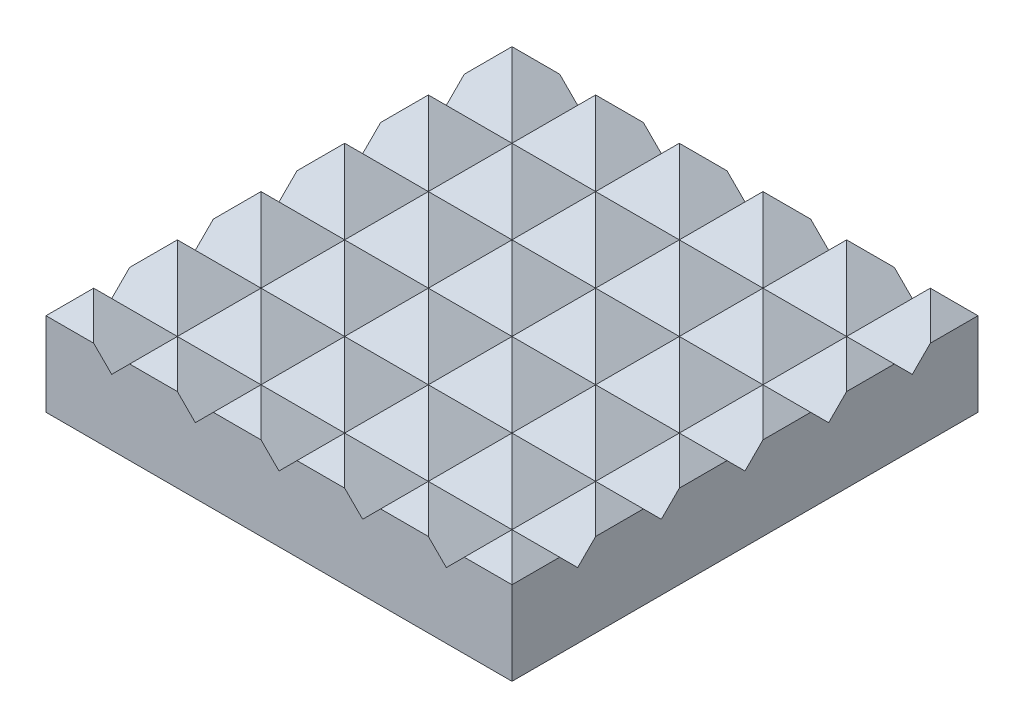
ISO-10303-21;
HEADER;
FILE_DESCRIPTION(('STEP AP214'),'2;1');
FILE_NAME('part.step','',(''),(''),'','','');
FILE_SCHEMA(('AUTOMOTIVE_DESIGN { 1 0 10303 214 1 1 1 1 }'));
ENDSEC;
DATA;
#1=APPLICATION_CONTEXT('core data for automotive mechanical design processes');
#2=APPLICATION_PROTOCOL_DEFINITION('international standard','automotive_design',2000,#1);
#3=PRODUCT_CONTEXT('',#1,'mechanical');
#4=PRODUCT('Part','Part','',(#3));
#5=PRODUCT_RELATED_PRODUCT_CATEGORY('part','',(#4));
#6=PRODUCT_DEFINITION_FORMATION('','',#4);
#7=PRODUCT_DEFINITION_CONTEXT('part definition',#1,'design');
#8=PRODUCT_DEFINITION('design','',#6,#7);
#9=PRODUCT_DEFINITION_SHAPE('','',#8);
#10=(LENGTH_UNIT() NAMED_UNIT(*) SI_UNIT(.MILLI.,.METRE.));
#11=(NAMED_UNIT(*) PLANE_ANGLE_UNIT() SI_UNIT($,.RADIAN.));
#12=(NAMED_UNIT(*) SI_UNIT($,.STERADIAN.) SOLID_ANGLE_UNIT());
#13=UNCERTAINTY_MEASURE_WITH_UNIT(LENGTH_MEASURE(1.E-05),#10,'distance_accuracy_value','');
#14=(GEOMETRIC_REPRESENTATION_CONTEXT(3) GLOBAL_UNCERTAINTY_ASSIGNED_CONTEXT((#13)) GLOBAL_UNIT_ASSIGNED_CONTEXT((#10,
#11,#12)) REPRESENTATION_CONTEXT('',''));
#15=CARTESIAN_POINT('',(0.,0.,0.));
#16=DIRECTION('',(0.,0.,1.));
#17=DIRECTION('',(1.,0.,0.));
#18=AXIS2_PLACEMENT_3D('',#15,#16,#17);
#19=CARTESIAN_POINT('',(-6.84,0.45,-6.35));
#20=DIRECTION('',(0.707106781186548,-0.707106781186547,0.));
#21=DIRECTION('',(0.707106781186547,0.707106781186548,0.));
#22=AXIS2_PLACEMENT_3D('',#19,#20,#21);
#23=PLANE('',#22);
#24=DIRECTION('',(0.577350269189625,0.577350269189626,-0.577350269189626));
#25=VECTOR('',#24,1.);
#26=CARTESIAN_POINT('',(-6.24333333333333,1.04666666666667,-5.15666666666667));
#27=LINE('',#26,#25);
#28=CARTESIAN_POINT('',(-6.35,0.94,-5.05));
#29=VERTEX_POINT('',#28);
#30=CARTESIAN_POINT('',(-5.7,1.59,-5.7));
#31=VERTEX_POINT('',#30);
#32=EDGE_CURVE('E482',#29,#31,#27,.T.);
#33=ORIENTED_EDGE('',*,*,#32,.T.);
#34=DIRECTION('',(-0.577350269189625,-0.577350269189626,-0.577350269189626));
#35=VECTOR('',#34,1.);
#36=CARTESIAN_POINT('',(-6.67666666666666,0.613333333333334,-6.67666666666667));
#37=LINE('',#36,#35);
#38=CARTESIAN_POINT('',(-6.35,0.940000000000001,-6.35));
#39=VERTEX_POINT('',#38);
#40=EDGE_CURVE('E455',#31,#39,#37,.T.);
#41=ORIENTED_EDGE('',*,*,#40,.T.);
#42=DIRECTION('',(0.,0.,-1.));
#43=VECTOR('',#42,1.);
#44=CARTESIAN_POINT('',(-6.35,0.939999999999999,6.35));
#45=LINE('',#44,#43);
#46=EDGE_CURVE('E489',#29,#39,#45,.T.);
#47=ORIENTED_EDGE('',*,*,#46,.F.);
#48=EDGE_LOOP('',(#33,#41,#47));
#49=FACE_BOUND('',#48,.T.);
#50=ADVANCED_FACE('F37',(#49),#23,.F.);
#51=CARTESIAN_POINT('',(-4.56,0.45,-6.35));
#52=DIRECTION('',(0.707106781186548,-0.707106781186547,0.));
#53=DIRECTION('',(0.707106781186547,0.707106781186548,0.));
#54=AXIS2_PLACEMENT_3D('',#51,#52,#53);
#55=PLANE('',#54);
#56=DIRECTION('',(0.577350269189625,0.577350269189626,-0.577350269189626));
#57=VECTOR('',#56,1.);
#58=CARTESIAN_POINT('',(-3.96333333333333,1.04666666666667,-5.15666666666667));
#59=LINE('',#58,#57);
#60=CARTESIAN_POINT('',(-4.56,0.45,-4.56));
#61=VERTEX_POINT('',#60);
#62=CARTESIAN_POINT('',(-3.42,1.59,-5.7));
#63=VERTEX_POINT('',#62);
#64=EDGE_CURVE('E487',#61,#63,#59,.T.);
#65=ORIENTED_EDGE('',*,*,#64,.T.);
#66=DIRECTION('',(-0.577350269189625,-0.577350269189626,-0.577350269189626));
#67=VECTOR('',#66,1.);
#68=CARTESIAN_POINT('',(-4.39666666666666,0.613333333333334,-6.67666666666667));
#69=LINE('',#68,#67);
#70=CARTESIAN_POINT('',(-4.07,0.940000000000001,-6.35));
#71=VERTEX_POINT('',#70);
#72=EDGE_CURVE('E1207',#63,#71,#69,.T.);
#73=ORIENTED_EDGE('',*,*,#72,.T.);
#74=DIRECTION('',(0.707106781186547,0.707106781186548,0.));
#75=VECTOR('',#74,1.);
#76=CARTESIAN_POINT('',(-4.56,0.45,-6.35));
#77=LINE('',#76,#75);
#78=CARTESIAN_POINT('',(-4.56,0.45,-6.35));
#79=VERTEX_POINT('',#78);
#80=EDGE_CURVE('E1110',#79,#71,#77,.T.);
#81=ORIENTED_EDGE('',*,*,#80,.F.);
#82=DIRECTION('',(0.,0.,1.));
#83=VECTOR('',#82,1.);
#84=CARTESIAN_POINT('',(-4.56,0.45,-6.35));
#85=LINE('',#84,#83);
#86=EDGE_CURVE('E1122',#79,#61,#85,.T.);
#87=ORIENTED_EDGE('',*,*,#86,.T.);
#88=EDGE_LOOP('',(#65,#73,#81,#87));
#89=FACE_BOUND('',#88,.T.);
#90=ADVANCED_FACE('F1363',(#89),#55,.F.);
#91=CARTESIAN_POINT('',(-5.7,1.59,-6.35));
#92=DIRECTION('',(-0.707106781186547,-0.707106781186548,0.));
#93=DIRECTION('',(0.707106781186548,-0.707106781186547,0.));
#94=AXIS2_PLACEMENT_3D('',#91,#92,#93);
#95=PLANE('',#94);
#96=DIRECTION('',(0.707106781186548,-0.707106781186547,0.));
#97=VECTOR('',#96,1.);
#98=CARTESIAN_POINT('',(-5.7,1.59,-6.35));
#99=LINE('',#98,#97);
#100=CARTESIAN_POINT('',(-5.05,0.940000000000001,-6.35));
#101=VERTEX_POINT('',#100);
#102=EDGE_CURVE('E476',#101,#79,#99,.T.);
#103=ORIENTED_EDGE('',*,*,#102,.F.);
#104=DIRECTION('',(-0.577350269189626,0.577350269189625,0.577350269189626));
#105=VECTOR('',#104,1.);
#106=CARTESIAN_POINT('',(-5.48333333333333,1.37333333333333,-5.91666666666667));
#107=LINE('',#106,#105);
#108=EDGE_CURVE('E458',#101,#31,#107,.T.);
#109=ORIENTED_EDGE('',*,*,#108,.T.);
#110=DIRECTION('',(0.577350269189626,-0.577350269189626,0.577350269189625));
#111=VECTOR('',#110,1.);
#112=CARTESIAN_POINT('',(-5.91666666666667,1.80666666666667,-5.91666666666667));
#113=LINE('',#112,#111);
#114=EDGE_CURVE('E474',#31,#61,#113,.T.);
#115=ORIENTED_EDGE('',*,*,#114,.T.);
#116=ORIENTED_EDGE('',*,*,#86,.F.);
#117=EDGE_LOOP('',(#103,#109,#115,#116));
#118=FACE_BOUND('',#117,.T.);
#119=ADVANCED_FACE('F472',(#118),#95,.F.);
#120=CARTESIAN_POINT('',(-2.28,0.45,-6.35));
#121=DIRECTION('',(0.707106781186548,-0.707106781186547,0.));
#122=DIRECTION('',(0.707106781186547,0.707106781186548,0.));
#123=AXIS2_PLACEMENT_3D('',#120,#121,#122);
#124=PLANE('',#123);
#125=DIRECTION('',(0.577350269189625,0.577350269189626,-0.577350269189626));
#126=VECTOR('',#125,1.);
#127=CARTESIAN_POINT('',(-1.68333333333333,1.04666666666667,-5.15666666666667));
#128=LINE('',#127,#126);
#129=CARTESIAN_POINT('',(-2.28,0.45,-4.56));
#130=VERTEX_POINT('',#129);
#131=CARTESIAN_POINT('',(-1.14,1.59,-5.7));
#132=VERTEX_POINT('',#131);
#133=EDGE_CURVE('E1353',#130,#132,#128,.T.);
#134=ORIENTED_EDGE('',*,*,#133,.T.);
#135=DIRECTION('',(-0.577350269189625,-0.577350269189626,-0.577350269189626));
#136=VECTOR('',#135,1.);
#137=CARTESIAN_POINT('',(-2.11666666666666,0.613333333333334,-6.67666666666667));
#138=LINE('',#137,#136);
#139=CARTESIAN_POINT('',(-1.79,0.940000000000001,-6.35));
#140=VERTEX_POINT('',#139);
#141=EDGE_CURVE('E1240',#132,#140,#138,.T.);
#142=ORIENTED_EDGE('',*,*,#141,.T.);
#143=DIRECTION('',(0.707106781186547,0.707106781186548,0.));
#144=VECTOR('',#143,1.);
#145=CARTESIAN_POINT('',(-2.28,0.45,-6.35));
#146=LINE('',#145,#144);
#147=CARTESIAN_POINT('',(-2.28,0.45,-6.35));
#148=VERTEX_POINT('',#147);
#149=EDGE_CURVE('E1080',#148,#140,#146,.T.);
#150=ORIENTED_EDGE('',*,*,#149,.F.);
#151=DIRECTION('',(0.,0.,1.));
#152=VECTOR('',#151,1.);
#153=CARTESIAN_POINT('',(-2.28,0.45,-6.35));
#154=LINE('',#153,#152);
#155=EDGE_CURVE('E1087',#148,#130,#154,.T.);
#156=ORIENTED_EDGE('',*,*,#155,.T.);
#157=EDGE_LOOP('',(#134,#142,#150,#156));
#158=FACE_BOUND('',#157,.T.);
#159=ADVANCED_FACE('F1995',(#158),#124,.F.);
#160=CARTESIAN_POINT('',(-3.42,1.59,-6.35));
#161=DIRECTION('',(-0.707106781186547,-0.707106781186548,0.));
#162=DIRECTION('',(0.707106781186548,-0.707106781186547,0.));
#163=AXIS2_PLACEMENT_3D('',#160,#161,#162);
#164=PLANE('',#163);
#165=DIRECTION('',(0.707106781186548,-0.707106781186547,0.));
#166=VECTOR('',#165,1.);
#167=CARTESIAN_POINT('',(-3.42,1.59,-6.35));
#168=LINE('',#167,#166);
#169=CARTESIAN_POINT('',(-2.77,0.940000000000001,-6.35));
#170=VERTEX_POINT('',#169);
#171=EDGE_CURVE('E1105',#170,#148,#168,.T.);
#172=ORIENTED_EDGE('',*,*,#171,.F.);
#173=DIRECTION('',(-0.577350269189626,0.577350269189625,0.577350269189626));
#174=VECTOR('',#173,1.);
#175=CARTESIAN_POINT('',(-3.20333333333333,1.37333333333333,-5.91666666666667));
#176=LINE('',#175,#174);
#177=EDGE_CURVE('E1247',#170,#63,#176,.T.);
#178=ORIENTED_EDGE('',*,*,#177,.T.);
#179=DIRECTION('',(0.577350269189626,-0.577350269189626,0.577350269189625));
#180=VECTOR('',#179,1.);
#181=CARTESIAN_POINT('',(-3.63666666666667,1.80666666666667,-5.91666666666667));
#182=LINE('',#181,#180);
#183=EDGE_CURVE('E1356',#63,#130,#182,.T.);
#184=ORIENTED_EDGE('',*,*,#183,.T.);
#185=ORIENTED_EDGE('',*,*,#155,.F.);
#186=EDGE_LOOP('',(#172,#178,#184,#185));
#187=FACE_BOUND('',#186,.T.);
#188=ADVANCED_FACE('F2001',(#187),#164,.F.);
#189=CARTESIAN_POINT('',(0.,0.45,-6.35));
#190=DIRECTION('',(0.707106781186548,-0.707106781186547,0.));
#191=DIRECTION('',(0.707106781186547,0.707106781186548,0.));
#192=AXIS2_PLACEMENT_3D('',#189,#190,#191);
#193=PLANE('',#192);
#194=DIRECTION('',(0.577350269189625,0.577350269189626,-0.577350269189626));
#195=VECTOR('',#194,1.);
#196=CARTESIAN_POINT('',(0.596666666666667,1.04666666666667,-5.15666666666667));
#197=LINE('',#196,#195);
#198=CARTESIAN_POINT('',(0.,0.45,-4.56));
#199=VERTEX_POINT('',#198);
#200=CARTESIAN_POINT('',(1.14,1.59,-5.7));
#201=VERTEX_POINT('',#200);
#202=EDGE_CURVE('E1346',#199,#201,#197,.T.);
#203=ORIENTED_EDGE('',*,*,#202,.T.);
#204=DIRECTION('',(-0.577350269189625,-0.577350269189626,-0.577350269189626));
#205=VECTOR('',#204,1.);
#206=CARTESIAN_POINT('',(0.163333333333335,0.613333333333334,-6.67666666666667));
#207=LINE('',#206,#205);
#208=CARTESIAN_POINT('',(0.490000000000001,0.940000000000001,-6.35));
#209=VERTEX_POINT('',#208);
#210=EDGE_CURVE('E1229',#201,#209,#207,.T.);
#211=ORIENTED_EDGE('',*,*,#210,.T.);
#212=DIRECTION('',(0.707106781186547,0.707106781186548,0.));
#213=VECTOR('',#212,1.);
#214=CARTESIAN_POINT('',(0.,0.45,-6.35));
#215=LINE('',#214,#213);
#216=CARTESIAN_POINT('',(0.,0.45,-6.35));
#217=VERTEX_POINT('',#216);
#218=EDGE_CURVE('E1059',#217,#209,#215,.T.);
#219=ORIENTED_EDGE('',*,*,#218,.F.);
#220=DIRECTION('',(0.,0.,1.));
#221=VECTOR('',#220,1.);
#222=CARTESIAN_POINT('',(0.,0.45,-6.35));
#223=LINE('',#222,#221);
#224=EDGE_CURVE('E1066',#217,#199,#223,.T.);
#225=ORIENTED_EDGE('',*,*,#224,.T.);
#226=EDGE_LOOP('',(#203,#211,#219,#225));
#227=FACE_BOUND('',#226,.T.);
#228=ADVANCED_FACE('F2007',(#227),#193,.F.);
#229=CARTESIAN_POINT('',(-1.14,1.59,-6.35));
#230=DIRECTION('',(-0.707106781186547,-0.707106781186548,0.));
#231=DIRECTION('',(0.707106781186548,-0.707106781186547,0.));
#232=AXIS2_PLACEMENT_3D('',#229,#230,#231);
#233=PLANE('',#232);
#234=DIRECTION('',(0.707106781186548,-0.707106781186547,0.));
#235=VECTOR('',#234,1.);
#236=CARTESIAN_POINT('',(-1.14,1.59,-6.35));
#237=LINE('',#236,#235);
#238=CARTESIAN_POINT('',(-0.49,0.940000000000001,-6.35));
#239=VERTEX_POINT('',#238);
#240=EDGE_CURVE('E1084',#239,#217,#237,.T.);
#241=ORIENTED_EDGE('',*,*,#240,.F.);
#242=DIRECTION('',(-0.577350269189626,0.577350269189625,0.577350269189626));
#243=VECTOR('',#242,1.);
#244=CARTESIAN_POINT('',(-0.923333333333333,1.37333333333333,-5.91666666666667));
#245=LINE('',#244,#243);
#246=EDGE_CURVE('E1236',#239,#132,#245,.T.);
#247=ORIENTED_EDGE('',*,*,#246,.T.);
#248=DIRECTION('',(0.577350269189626,-0.577350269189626,0.577350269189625));
#249=VECTOR('',#248,1.);
#250=CARTESIAN_POINT('',(-1.35666666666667,1.80666666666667,-5.91666666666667));
#251=LINE('',#250,#249);
#252=EDGE_CURVE('E1350',#132,#199,#251,.T.);
#253=ORIENTED_EDGE('',*,*,#252,.T.);
#254=ORIENTED_EDGE('',*,*,#224,.F.);
#255=EDGE_LOOP('',(#241,#247,#253,#254));
#256=FACE_BOUND('',#255,.T.);
#257=ADVANCED_FACE('F2126',(#256),#233,.F.);
#258=CARTESIAN_POINT('',(2.28,0.45,-6.35));
#259=DIRECTION('',(0.707106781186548,-0.707106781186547,0.));
#260=DIRECTION('',(0.707106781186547,0.707106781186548,0.));
#261=AXIS2_PLACEMENT_3D('',#258,#259,#260);
#262=PLANE('',#261);
#263=DIRECTION('',(0.577350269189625,0.577350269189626,-0.577350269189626));
#264=VECTOR('',#263,1.);
#265=CARTESIAN_POINT('',(2.87666666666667,1.04666666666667,-5.15666666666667));
#266=LINE('',#265,#264);
#267=CARTESIAN_POINT('',(2.28,0.45,-4.56));
#268=VERTEX_POINT('',#267);
#269=CARTESIAN_POINT('',(3.42,1.59,-5.7));
#270=VERTEX_POINT('',#269);
#271=EDGE_CURVE('E1338',#268,#270,#266,.T.);
#272=ORIENTED_EDGE('',*,*,#271,.T.);
#273=DIRECTION('',(-0.577350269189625,-0.577350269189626,-0.577350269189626));
#274=VECTOR('',#273,1.);
#275=CARTESIAN_POINT('',(2.44333333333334,0.613333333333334,-6.67666666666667));
#276=LINE('',#275,#274);
#277=CARTESIAN_POINT('',(2.77,0.940000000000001,-6.35));
#278=VERTEX_POINT('',#277);
#279=EDGE_CURVE('E1216',#270,#278,#276,.T.);
#280=ORIENTED_EDGE('',*,*,#279,.T.);
#281=DIRECTION('',(0.707106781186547,0.707106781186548,0.));
#282=VECTOR('',#281,1.);
#283=CARTESIAN_POINT('',(2.28,0.45,-6.35));
#284=LINE('',#283,#282);
#285=CARTESIAN_POINT('',(2.28,0.45,-6.35));
#286=VERTEX_POINT('',#285);
#287=EDGE_CURVE('E1038',#286,#278,#284,.T.);
#288=ORIENTED_EDGE('',*,*,#287,.F.);
#289=DIRECTION('',(0.,0.,1.));
#290=VECTOR('',#289,1.);
#291=CARTESIAN_POINT('',(2.28,0.45,-6.35));
#292=LINE('',#291,#290);
#293=EDGE_CURVE('E1045',#286,#268,#292,.T.);
#294=ORIENTED_EDGE('',*,*,#293,.T.);
#295=EDGE_LOOP('',(#272,#280,#288,#294));
#296=FACE_BOUND('',#295,.T.);
#297=ADVANCED_FACE('F1781',(#296),#262,.F.);
#298=CARTESIAN_POINT('',(1.14,1.59,-6.35));
#299=DIRECTION('',(-0.707106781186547,-0.707106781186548,0.));
#300=DIRECTION('',(0.707106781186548,-0.707106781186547,0.));
#301=AXIS2_PLACEMENT_3D('',#298,#299,#300);
#302=PLANE('',#301);
#303=DIRECTION('',(0.707106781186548,-0.707106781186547,0.));
#304=VECTOR('',#303,1.);
#305=CARTESIAN_POINT('',(1.14,1.59,-6.35));
#306=LINE('',#305,#304);
#307=CARTESIAN_POINT('',(1.79,0.940000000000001,-6.35));
#308=VERTEX_POINT('',#307);
#309=EDGE_CURVE('E1063',#308,#286,#306,.T.);
#310=ORIENTED_EDGE('',*,*,#309,.F.);
#311=DIRECTION('',(-0.577350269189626,0.577350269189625,0.577350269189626));
#312=VECTOR('',#311,1.);
#313=CARTESIAN_POINT('',(1.35666666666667,1.37333333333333,-5.91666666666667));
#314=LINE('',#313,#312);
#315=EDGE_CURVE('E1223',#308,#201,#314,.T.);
#316=ORIENTED_EDGE('',*,*,#315,.T.);
#317=DIRECTION('',(0.577350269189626,-0.577350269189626,0.577350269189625));
#318=VECTOR('',#317,1.);
#319=CARTESIAN_POINT('',(0.923333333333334,1.80666666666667,-5.91666666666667));
#320=LINE('',#319,#318);
#321=EDGE_CURVE('E1342',#201,#268,#320,.T.);
#322=ORIENTED_EDGE('',*,*,#321,.T.);
#323=ORIENTED_EDGE('',*,*,#293,.F.);
#324=EDGE_LOOP('',(#310,#316,#322,#323));
#325=FACE_BOUND('',#324,.T.);
#326=ADVANCED_FACE('F1783',(#325),#302,.F.);
#327=CARTESIAN_POINT('',(4.56,0.45,-6.35));
#328=DIRECTION('',(0.707106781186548,-0.707106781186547,0.));
#329=DIRECTION('',(0.707106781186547,0.707106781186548,0.));
#330=AXIS2_PLACEMENT_3D('',#327,#328,#329);
#331=PLANE('',#330);
#332=DIRECTION('',(0.577350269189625,0.577350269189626,-0.577350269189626));
#333=VECTOR('',#332,1.);
#334=CARTESIAN_POINT('',(5.15666666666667,1.04666666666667,-5.15666666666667));
#335=LINE('',#334,#333);
#336=CARTESIAN_POINT('',(4.56,0.45,-4.56));
#337=VERTEX_POINT('',#336);
#338=CARTESIAN_POINT('',(5.7,1.59,-5.7));
#339=VERTEX_POINT('',#338);
#340=EDGE_CURVE('E1330',#337,#339,#335,.T.);
#341=ORIENTED_EDGE('',*,*,#340,.T.);
#342=DIRECTION('',(-0.577350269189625,-0.577350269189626,-0.577350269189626));
#343=VECTOR('',#342,1.);
#344=CARTESIAN_POINT('',(4.72333333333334,0.613333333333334,-6.67666666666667));
#345=LINE('',#344,#343);
#346=CARTESIAN_POINT('',(5.05,0.940000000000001,-6.35));
#347=VERTEX_POINT('',#346);
#348=EDGE_CURVE('E1204',#339,#347,#345,.T.);
#349=ORIENTED_EDGE('',*,*,#348,.T.);
#350=DIRECTION('',(0.707106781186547,0.707106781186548,0.));
#351=VECTOR('',#350,1.);
#352=CARTESIAN_POINT('',(4.56,0.45,-6.35));
#353=LINE('',#352,#351);
#354=CARTESIAN_POINT('',(4.56,0.45,-6.35));
#355=VERTEX_POINT('',#354);
#356=EDGE_CURVE('E1021',#355,#347,#353,.T.);
#357=ORIENTED_EDGE('',*,*,#356,.F.);
#358=DIRECTION('',(0.,0.,1.));
#359=VECTOR('',#358,1.);
#360=CARTESIAN_POINT('',(4.56,0.45,-6.35));
#361=LINE('',#360,#359);
#362=EDGE_CURVE('E1024',#355,#337,#361,.T.);
#363=ORIENTED_EDGE('',*,*,#362,.T.);
#364=EDGE_LOOP('',(#341,#349,#357,#363));
#365=FACE_BOUND('',#364,.T.);
#366=ADVANCED_FACE('F1411',(#365),#331,.F.);
#367=CARTESIAN_POINT('',(3.42,1.59,-6.35));
#368=DIRECTION('',(-0.707106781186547,-0.707106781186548,0.));
#369=DIRECTION('',(0.707106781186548,-0.707106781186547,0.));
#370=AXIS2_PLACEMENT_3D('',#367,#368,#369);
#371=PLANE('',#370);
#372=DIRECTION('',(0.707106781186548,-0.707106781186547,0.));
#373=VECTOR('',#372,1.);
#374=CARTESIAN_POINT('',(3.42,1.59,-6.35));
#375=LINE('',#374,#373);
#376=CARTESIAN_POINT('',(4.07,0.940000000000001,-6.35));
#377=VERTEX_POINT('',#376);
#378=EDGE_CURVE('E1042',#377,#355,#375,.T.);
#379=ORIENTED_EDGE('',*,*,#378,.F.);
#380=DIRECTION('',(-0.577350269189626,0.577350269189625,0.577350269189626));
#381=VECTOR('',#380,1.);
#382=CARTESIAN_POINT('',(3.63666666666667,1.37333333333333,-5.91666666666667));
#383=LINE('',#382,#381);
#384=EDGE_CURVE('E1211',#377,#270,#383,.T.);
#385=ORIENTED_EDGE('',*,*,#384,.T.);
#386=DIRECTION('',(0.577350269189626,-0.577350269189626,0.577350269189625));
#387=VECTOR('',#386,1.);
#388=CARTESIAN_POINT('',(3.20333333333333,1.80666666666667,-5.91666666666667));
#389=LINE('',#388,#387);
#390=EDGE_CURVE('E1334',#270,#337,#389,.T.);
#391=ORIENTED_EDGE('',*,*,#390,.T.);
#392=ORIENTED_EDGE('',*,*,#362,.F.);
#393=EDGE_LOOP('',(#379,#385,#391,#392));
#394=FACE_BOUND('',#393,.T.);
#395=ADVANCED_FACE('F1415',(#394),#371,.F.);
#396=CARTESIAN_POINT('',(5.7,1.59,-6.35));
#397=DIRECTION('',(-0.707106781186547,-0.707106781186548,0.));
#398=DIRECTION('',(0.707106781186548,-0.707106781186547,0.));
#399=AXIS2_PLACEMENT_3D('',#396,#397,#398);
#400=PLANE('',#399);
#401=DIRECTION('',(0.,0.,1.));
#402=VECTOR('',#401,1.);
#403=CARTESIAN_POINT('',(6.35,0.940000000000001,6.35));
#404=LINE('',#403,#402);
#405=CARTESIAN_POINT('',(6.35,0.940000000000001,-6.35));
#406=VERTEX_POINT('',#405);
#407=CARTESIAN_POINT('',(6.35,0.940000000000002,-5.05));
#408=VERTEX_POINT('',#407);
#409=EDGE_CURVE('E1017',#406,#408,#404,.T.);
#410=ORIENTED_EDGE('',*,*,#409,.F.);
#411=DIRECTION('',(-0.577350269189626,0.577350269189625,0.577350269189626));
#412=VECTOR('',#411,1.);
#413=CARTESIAN_POINT('',(5.91666666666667,1.37333333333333,-5.91666666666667));
#414=LINE('',#413,#412);
#415=EDGE_CURVE('E1196',#406,#339,#414,.T.);
#416=ORIENTED_EDGE('',*,*,#415,.T.);
#417=DIRECTION('',(0.577350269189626,-0.577350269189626,0.577350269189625));
#418=VECTOR('',#417,1.);
#419=CARTESIAN_POINT('',(5.48333333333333,1.80666666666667,-5.91666666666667));
#420=LINE('',#419,#418);
#421=EDGE_CURVE('E1326',#339,#408,#420,.T.);
#422=ORIENTED_EDGE('',*,*,#421,.T.);
#423=EDGE_LOOP('',(#410,#416,#422));
#424=FACE_BOUND('',#423,.T.);
#425=ADVANCED_FACE('F1409',(#424),#400,.F.);
#426=DIRECTION('',(0.577350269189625,0.577350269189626,-0.577350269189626));
#427=VECTOR('',#426,1.);
#428=CARTESIAN_POINT('',(-5.48333333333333,1.80666666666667,-3.63666666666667));
#429=LINE('',#428,#427);
#430=CARTESIAN_POINT('',(-6.35,0.939999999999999,-2.77));
#431=VERTEX_POINT('',#430);
#432=CARTESIAN_POINT('',(-5.7,1.59,-3.42));
#433=VERTEX_POINT('',#432);
#434=EDGE_CURVE('E610',#431,#433,#429,.T.);
#435=ORIENTED_EDGE('',*,*,#434,.T.);
#436=DIRECTION('',(-0.577350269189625,-0.577350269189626,-0.577350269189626));
#437=VECTOR('',#436,1.);
#438=CARTESIAN_POINT('',(-7.43666666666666,-0.146666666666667,-5.15666666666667));
#439=LINE('',#438,#437);
#440=CARTESIAN_POINT('',(-6.35,0.939999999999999,-4.07));
#441=VERTEX_POINT('',#440);
#442=EDGE_CURVE('E1322',#433,#441,#439,.T.);
#443=ORIENTED_EDGE('',*,*,#442,.T.);
#444=EDGE_CURVE('E1706',#431,#441,#45,.T.);
#445=ORIENTED_EDGE('',*,*,#444,.F.);
#446=EDGE_LOOP('',(#435,#443,#445));
#447=FACE_BOUND('',#446,.T.);
#448=ADVANCED_FACE('F1593',(#447),#23,.F.);
#449=DIRECTION('',(0.577350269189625,0.577350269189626,-0.577350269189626));
#450=VECTOR('',#449,1.);
#451=CARTESIAN_POINT('',(-3.20333333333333,1.80666666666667,-3.63666666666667));
#452=LINE('',#451,#450);
#453=CARTESIAN_POINT('',(-4.56,0.45,-2.28));
#454=VERTEX_POINT('',#453);
#455=CARTESIAN_POINT('',(-3.42,1.59,-3.42));
#456=VERTEX_POINT('',#455);
#457=EDGE_CURVE('E602',#454,#456,#452,.T.);
#458=ORIENTED_EDGE('',*,*,#457,.T.);
#459=DIRECTION('',(-0.577350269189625,-0.577350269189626,-0.577350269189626));
#460=VECTOR('',#459,1.);
#461=CARTESIAN_POINT('',(-5.15666666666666,-0.146666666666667,-5.15666666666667));
#462=LINE('',#461,#460);
#463=EDGE_CURVE('E1315',#456,#61,#462,.T.);
#464=ORIENTED_EDGE('',*,*,#463,.T.);
#465=EDGE_CURVE('E1126',#61,#454,#85,.T.);
#466=ORIENTED_EDGE('',*,*,#465,.T.);
#467=EDGE_LOOP('',(#458,#464,#466));
#468=FACE_BOUND('',#467,.T.);
#469=ADVANCED_FACE('F1598',(#468),#55,.F.);
#470=ORIENTED_EDGE('',*,*,#465,.F.);
#471=DIRECTION('',(-0.577350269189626,0.577350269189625,0.577350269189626));
#472=VECTOR('',#471,1.);
#473=CARTESIAN_POINT('',(-4.72333333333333,0.613333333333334,-4.39666666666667));
#474=LINE('',#473,#472);
#475=EDGE_CURVE('E1318',#61,#433,#474,.T.);
#476=ORIENTED_EDGE('',*,*,#475,.T.);
#477=DIRECTION('',(0.577350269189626,-0.577350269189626,0.577350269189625));
#478=VECTOR('',#477,1.);
#479=CARTESIAN_POINT('',(-6.67666666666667,2.56666666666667,-4.39666666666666));
#480=LINE('',#479,#478);
#481=EDGE_CURVE('E606',#433,#454,#480,.T.);
#482=ORIENTED_EDGE('',*,*,#481,.T.);
#483=EDGE_LOOP('',(#470,#476,#482));
#484=FACE_BOUND('',#483,.T.);
#485=ADVANCED_FACE('F1993',(#484),#95,.F.);
#486=DIRECTION('',(0.577350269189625,0.577350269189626,-0.577350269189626));
#487=VECTOR('',#486,1.);
#488=CARTESIAN_POINT('',(-0.923333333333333,1.80666666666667,-3.63666666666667));
#489=LINE('',#488,#487);
#490=CARTESIAN_POINT('',(-2.28,0.45,-2.28));
#491=VERTEX_POINT('',#490);
#492=CARTESIAN_POINT('',(-1.14,1.59,-3.42));
#493=VERTEX_POINT('',#492);
#494=EDGE_CURVE('E594',#491,#493,#489,.T.);
#495=ORIENTED_EDGE('',*,*,#494,.T.);
#496=DIRECTION('',(-0.577350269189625,-0.577350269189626,-0.577350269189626));
#497=VECTOR('',#496,1.);
#498=CARTESIAN_POINT('',(-2.87666666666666,-0.146666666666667,-5.15666666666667));
#499=LINE('',#498,#497);
#500=EDGE_CURVE('E1307',#493,#130,#499,.T.);
#501=ORIENTED_EDGE('',*,*,#500,.T.);
#502=EDGE_CURVE('E1092',#130,#491,#154,.T.);
#503=ORIENTED_EDGE('',*,*,#502,.T.);
#504=EDGE_LOOP('',(#495,#501,#503));
#505=FACE_BOUND('',#504,.T.);
#506=ADVANCED_FACE('F1937',(#505),#124,.F.);
#507=ORIENTED_EDGE('',*,*,#502,.F.);
#508=DIRECTION('',(-0.577350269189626,0.577350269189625,0.577350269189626));
#509=VECTOR('',#508,1.);
#510=CARTESIAN_POINT('',(-2.44333333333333,0.613333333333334,-4.39666666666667));
#511=LINE('',#510,#509);
#512=EDGE_CURVE('E1311',#130,#456,#511,.T.);
#513=ORIENTED_EDGE('',*,*,#512,.T.);
#514=DIRECTION('',(0.577350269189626,-0.577350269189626,0.577350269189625));
#515=VECTOR('',#514,1.);
#516=CARTESIAN_POINT('',(-4.39666666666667,2.56666666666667,-4.39666666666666));
#517=LINE('',#516,#515);
#518=EDGE_CURVE('E598',#456,#491,#517,.T.);
#519=ORIENTED_EDGE('',*,*,#518,.T.);
#520=EDGE_LOOP('',(#507,#513,#519));
#521=FACE_BOUND('',#520,.T.);
#522=ADVANCED_FACE('F1992',(#521),#164,.F.);
#523=DIRECTION('',(0.577350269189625,0.577350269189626,-0.577350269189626));
#524=VECTOR('',#523,1.);
#525=CARTESIAN_POINT('',(1.35666666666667,1.80666666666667,-3.63666666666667));
#526=LINE('',#525,#524);
#527=CARTESIAN_POINT('',(0.,0.449999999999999,-2.28));
#528=VERTEX_POINT('',#527);
#529=CARTESIAN_POINT('',(1.14,1.59,-3.42));
#530=VERTEX_POINT('',#529);
#531=EDGE_CURVE('E586',#528,#530,#526,.T.);
#532=ORIENTED_EDGE('',*,*,#531,.T.);
#533=DIRECTION('',(-0.577350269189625,-0.577350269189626,-0.577350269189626));
#534=VECTOR('',#533,1.);
#535=CARTESIAN_POINT('',(-0.596666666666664,-0.146666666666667,-5.15666666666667));
#536=LINE('',#535,#534);
#537=EDGE_CURVE('E1299',#530,#199,#536,.T.);
#538=ORIENTED_EDGE('',*,*,#537,.T.);
#539=EDGE_CURVE('E1071',#199,#528,#223,.T.);
#540=ORIENTED_EDGE('',*,*,#539,.T.);
#541=EDGE_LOOP('',(#532,#538,#540));
#542=FACE_BOUND('',#541,.T.);
#543=ADVANCED_FACE('F2000',(#542),#193,.F.);
#544=ORIENTED_EDGE('',*,*,#539,.F.);
#545=DIRECTION('',(-0.577350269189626,0.577350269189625,0.577350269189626));
#546=VECTOR('',#545,1.);
#547=CARTESIAN_POINT('',(-0.163333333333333,0.613333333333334,-4.39666666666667));
#548=LINE('',#547,#546);
#549=EDGE_CURVE('E1303',#199,#493,#548,.T.);
#550=ORIENTED_EDGE('',*,*,#549,.T.);
#551=DIRECTION('',(0.577350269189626,-0.577350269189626,0.577350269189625));
#552=VECTOR('',#551,1.);
#553=CARTESIAN_POINT('',(-2.11666666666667,2.56666666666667,-4.39666666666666));
#554=LINE('',#553,#552);
#555=EDGE_CURVE('E590',#493,#528,#554,.T.);
#556=ORIENTED_EDGE('',*,*,#555,.T.);
#557=EDGE_LOOP('',(#544,#550,#556));
#558=FACE_BOUND('',#557,.T.);
#559=ADVANCED_FACE('F1932',(#558),#233,.F.);
#560=DIRECTION('',(0.577350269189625,0.577350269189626,-0.577350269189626));
#561=VECTOR('',#560,1.);
#562=CARTESIAN_POINT('',(3.63666666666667,1.80666666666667,-3.63666666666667));
#563=LINE('',#562,#561);
#564=CARTESIAN_POINT('',(2.28,0.449999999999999,-2.28));
#565=VERTEX_POINT('',#564);
#566=CARTESIAN_POINT('',(3.42,1.59,-3.42));
#567=VERTEX_POINT('',#566);
#568=EDGE_CURVE('E578',#565,#567,#563,.T.);
#569=ORIENTED_EDGE('',*,*,#568,.T.);
#570=DIRECTION('',(-0.577350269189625,-0.577350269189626,-0.577350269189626));
#571=VECTOR('',#570,1.);
#572=CARTESIAN_POINT('',(1.68333333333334,-0.146666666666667,-5.15666666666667));
#573=LINE('',#572,#571);
#574=EDGE_CURVE('E1291',#567,#268,#573,.T.);
#575=ORIENTED_EDGE('',*,*,#574,.T.);
#576=EDGE_CURVE('E1050',#268,#565,#292,.T.);
#577=ORIENTED_EDGE('',*,*,#576,.T.);
#578=EDGE_LOOP('',(#569,#575,#577));
#579=FACE_BOUND('',#578,.T.);
#580=ADVANCED_FACE('F1785',(#579),#262,.F.);
#581=ORIENTED_EDGE('',*,*,#576,.F.);
#582=DIRECTION('',(-0.577350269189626,0.577350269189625,0.577350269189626));
#583=VECTOR('',#582,1.);
#584=CARTESIAN_POINT('',(2.11666666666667,0.613333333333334,-4.39666666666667));
#585=LINE('',#584,#583);
#586=EDGE_CURVE('E1295',#268,#530,#585,.T.);
#587=ORIENTED_EDGE('',*,*,#586,.T.);
#588=DIRECTION('',(0.577350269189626,-0.577350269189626,0.577350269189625));
#589=VECTOR('',#588,1.);
#590=CARTESIAN_POINT('',(0.163333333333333,2.56666666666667,-4.39666666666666));
#591=LINE('',#590,#589);
#592=EDGE_CURVE('E582',#530,#565,#591,.T.);
#593=ORIENTED_EDGE('',*,*,#592,.T.);
#594=EDGE_LOOP('',(#581,#587,#593));
#595=FACE_BOUND('',#594,.T.);
#596=ADVANCED_FACE('F1788',(#595),#302,.F.);
#597=DIRECTION('',(0.577350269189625,0.577350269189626,-0.577350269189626));
#598=VECTOR('',#597,1.);
#599=CARTESIAN_POINT('',(5.91666666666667,1.80666666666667,-3.63666666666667));
#600=LINE('',#599,#598);
#601=CARTESIAN_POINT('',(4.56,0.449999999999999,-2.28));
#602=VERTEX_POINT('',#601);
#603=CARTESIAN_POINT('',(5.7,1.59,-3.42));
#604=VERTEX_POINT('',#603);
#605=EDGE_CURVE('E570',#602,#604,#600,.T.);
#606=ORIENTED_EDGE('',*,*,#605,.T.);
#607=DIRECTION('',(-0.577350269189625,-0.577350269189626,-0.577350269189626));
#608=VECTOR('',#607,1.);
#609=CARTESIAN_POINT('',(3.96333333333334,-0.146666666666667,-5.15666666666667));
#610=LINE('',#609,#608);
#611=EDGE_CURVE('E1283',#604,#337,#610,.T.);
#612=ORIENTED_EDGE('',*,*,#611,.T.);
#613=EDGE_CURVE('E1029',#337,#602,#361,.T.);
#614=ORIENTED_EDGE('',*,*,#613,.T.);
#615=EDGE_LOOP('',(#606,#612,#614));
#616=FACE_BOUND('',#615,.T.);
#617=ADVANCED_FACE('F1418',(#616),#331,.F.);
#618=ORIENTED_EDGE('',*,*,#613,.F.);
#619=DIRECTION('',(-0.577350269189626,0.577350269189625,0.577350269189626));
#620=VECTOR('',#619,1.);
#621=CARTESIAN_POINT('',(4.39666666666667,0.613333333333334,-4.39666666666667));
#622=LINE('',#621,#620);
#623=EDGE_CURVE('E1287',#337,#567,#622,.T.);
#624=ORIENTED_EDGE('',*,*,#623,.T.);
#625=DIRECTION('',(0.577350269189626,-0.577350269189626,0.577350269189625));
#626=VECTOR('',#625,1.);
#627=CARTESIAN_POINT('',(2.44333333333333,2.56666666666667,-4.39666666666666));
#628=LINE('',#627,#626);
#629=EDGE_CURVE('E574',#567,#602,#628,.T.);
#630=ORIENTED_EDGE('',*,*,#629,.T.);
#631=EDGE_LOOP('',(#618,#624,#630));
#632=FACE_BOUND('',#631,.T.);
#633=ADVANCED_FACE('F1422',(#632),#371,.F.);
#634=CARTESIAN_POINT('',(6.35,0.940000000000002,-4.07));
#635=VERTEX_POINT('',#634);
#636=CARTESIAN_POINT('',(6.35,0.940000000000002,-2.77));
#637=VERTEX_POINT('',#636);
#638=EDGE_CURVE('E1022',#635,#637,#404,.T.);
#639=ORIENTED_EDGE('',*,*,#638,.F.);
#640=DIRECTION('',(-0.577350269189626,0.577350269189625,0.577350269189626));
#641=VECTOR('',#640,1.);
#642=CARTESIAN_POINT('',(6.67666666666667,0.613333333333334,-4.39666666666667));
#643=LINE('',#642,#641);
#644=EDGE_CURVE('E1270',#635,#604,#643,.T.);
#645=ORIENTED_EDGE('',*,*,#644,.T.);
#646=DIRECTION('',(0.577350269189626,-0.577350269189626,0.577350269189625));
#647=VECTOR('',#646,1.);
#648=CARTESIAN_POINT('',(4.72333333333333,2.56666666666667,-4.39666666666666));
#649=LINE('',#648,#647);
#650=EDGE_CURVE('E566',#604,#637,#649,.T.);
#651=ORIENTED_EDGE('',*,*,#650,.T.);
#652=EDGE_LOOP('',(#639,#645,#651));
#653=FACE_BOUND('',#652,.T.);
#654=ADVANCED_FACE('F1507',(#653),#400,.F.);
#655=DIRECTION('',(0.577350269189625,0.577350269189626,-0.577350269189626));
#656=VECTOR('',#655,1.);
#657=CARTESIAN_POINT('',(-4.72333333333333,2.56666666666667,-2.11666666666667));
#658=LINE('',#657,#656);
#659=CARTESIAN_POINT('',(-6.35,0.939999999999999,-0.49));
#660=VERTEX_POINT('',#659);
#661=CARTESIAN_POINT('',(-5.7,1.59,-1.14));
#662=VERTEX_POINT('',#661);
#663=EDGE_CURVE('E728',#660,#662,#658,.T.);
#664=ORIENTED_EDGE('',*,*,#663,.T.);
#665=DIRECTION('',(-0.577350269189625,-0.577350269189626,-0.577350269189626));
#666=VECTOR('',#665,1.);
#667=CARTESIAN_POINT('',(-8.19666666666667,-0.906666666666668,-3.63666666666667));
#668=LINE('',#667,#666);
#669=CARTESIAN_POINT('',(-6.35,0.94,-1.79));
#670=VERTEX_POINT('',#669);
#671=EDGE_CURVE('E562',#662,#670,#668,.T.);
#672=ORIENTED_EDGE('',*,*,#671,.T.);
#673=EDGE_CURVE('E1645',#660,#670,#45,.T.);
#674=ORIENTED_EDGE('',*,*,#673,.F.);
#675=EDGE_LOOP('',(#664,#672,#674));
#676=FACE_BOUND('',#675,.T.);
#677=ADVANCED_FACE('F1603',(#676),#23,.F.);
#678=DIRECTION('',(0.577350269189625,0.577350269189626,-0.577350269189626));
#679=VECTOR('',#678,1.);
#680=CARTESIAN_POINT('',(-2.44333333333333,2.56666666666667,-2.11666666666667));
#681=LINE('',#680,#679);
#682=CARTESIAN_POINT('',(-4.56,0.449999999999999,0.));
#683=VERTEX_POINT('',#682);
#684=CARTESIAN_POINT('',(-3.42,1.59,-1.14));
#685=VERTEX_POINT('',#684);
#686=EDGE_CURVE('E720',#683,#685,#681,.T.);
#687=ORIENTED_EDGE('',*,*,#686,.T.);
#688=DIRECTION('',(-0.577350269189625,-0.577350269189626,-0.577350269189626));
#689=VECTOR('',#688,1.);
#690=CARTESIAN_POINT('',(-5.91666666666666,-0.906666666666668,-3.63666666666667));
#691=LINE('',#690,#689);
#692=EDGE_CURVE('E554',#685,#454,#691,.T.);
#693=ORIENTED_EDGE('',*,*,#692,.T.);
#694=EDGE_CURVE('E1702',#454,#683,#85,.T.);
#695=ORIENTED_EDGE('',*,*,#694,.T.);
#696=EDGE_LOOP('',(#687,#693,#695));
#697=FACE_BOUND('',#696,.T.);
#698=ADVANCED_FACE('F1633',(#697),#55,.F.);
#699=ORIENTED_EDGE('',*,*,#694,.F.);
#700=DIRECTION('',(-0.577350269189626,0.577350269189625,0.577350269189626));
#701=VECTOR('',#700,1.);
#702=CARTESIAN_POINT('',(-3.96333333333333,-0.146666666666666,-2.87666666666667));
#703=LINE('',#702,#701);
#704=EDGE_CURVE('E558',#454,#662,#703,.T.);
#705=ORIENTED_EDGE('',*,*,#704,.T.);
#706=DIRECTION('',(0.577350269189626,-0.577350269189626,0.577350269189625));
#707=VECTOR('',#706,1.);
#708=CARTESIAN_POINT('',(-7.43666666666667,3.32666666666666,-2.87666666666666));
#709=LINE('',#708,#707);
#710=EDGE_CURVE('E724',#662,#683,#709,.T.);
#711=ORIENTED_EDGE('',*,*,#710,.T.);
#712=EDGE_LOOP('',(#699,#705,#711));
#713=FACE_BOUND('',#712,.T.);
#714=ADVANCED_FACE('F1641',(#713),#95,.F.);
#715=DIRECTION('',(0.577350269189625,0.577350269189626,-0.577350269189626));
#716=VECTOR('',#715,1.);
#717=CARTESIAN_POINT('',(-0.163333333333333,2.56666666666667,-2.11666666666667));
#718=LINE('',#717,#716);
#719=CARTESIAN_POINT('',(-2.28,0.449999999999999,0.));
#720=VERTEX_POINT('',#719);
#721=CARTESIAN_POINT('',(-1.14,1.59,-1.14));
#722=VERTEX_POINT('',#721);
#723=EDGE_CURVE('E712',#720,#722,#718,.T.);
#724=ORIENTED_EDGE('',*,*,#723,.T.);
#725=DIRECTION('',(-0.577350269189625,-0.577350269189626,-0.577350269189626));
#726=VECTOR('',#725,1.);
#727=CARTESIAN_POINT('',(-3.63666666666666,-0.906666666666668,-3.63666666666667));
#728=LINE('',#727,#726);
#729=EDGE_CURVE('E546',#722,#491,#728,.T.);
#730=ORIENTED_EDGE('',*,*,#729,.T.);
#731=EDGE_CURVE('E1881',#491,#720,#154,.T.);
#732=ORIENTED_EDGE('',*,*,#731,.T.);
#733=EDGE_LOOP('',(#724,#730,#732));
#734=FACE_BOUND('',#733,.T.);
#735=ADVANCED_FACE('F1978',(#734),#124,.F.);
#736=ORIENTED_EDGE('',*,*,#731,.F.);
#737=DIRECTION('',(-0.577350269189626,0.577350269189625,0.577350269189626));
#738=VECTOR('',#737,1.);
#739=CARTESIAN_POINT('',(-1.68333333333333,-0.146666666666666,-2.87666666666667));
#740=LINE('',#739,#738);
#741=EDGE_CURVE('E550',#491,#685,#740,.T.);
#742=ORIENTED_EDGE('',*,*,#741,.T.);
#743=DIRECTION('',(0.577350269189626,-0.577350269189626,0.577350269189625));
#744=VECTOR('',#743,1.);
#745=CARTESIAN_POINT('',(-5.15666666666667,3.32666666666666,-2.87666666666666));
#746=LINE('',#745,#744);
#747=EDGE_CURVE('E716',#685,#720,#746,.T.);
#748=ORIENTED_EDGE('',*,*,#747,.T.);
#749=EDGE_LOOP('',(#736,#742,#748));
#750=FACE_BOUND('',#749,.T.);
#751=ADVANCED_FACE('F1950',(#750),#164,.F.);
#752=DIRECTION('',(0.577350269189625,0.577350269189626,-0.577350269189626));
#753=VECTOR('',#752,1.);
#754=CARTESIAN_POINT('',(2.11666666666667,2.56666666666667,-2.11666666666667));
#755=LINE('',#754,#753);
#756=CARTESIAN_POINT('',(0.,0.449999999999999,0.));
#757=VERTEX_POINT('',#756);
#758=CARTESIAN_POINT('',(1.14,1.59,-1.14));
#759=VERTEX_POINT('',#758);
#760=EDGE_CURVE('E704',#757,#759,#755,.T.);
#761=ORIENTED_EDGE('',*,*,#760,.T.);
#762=DIRECTION('',(-0.577350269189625,-0.577350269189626,-0.577350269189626));
#763=VECTOR('',#762,1.);
#764=CARTESIAN_POINT('',(-1.35666666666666,-0.906666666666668,-3.63666666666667));
#765=LINE('',#764,#763);
#766=EDGE_CURVE('E538',#759,#528,#765,.T.);
#767=ORIENTED_EDGE('',*,*,#766,.T.);
#768=EDGE_CURVE('E1857',#528,#757,#223,.T.);
#769=ORIENTED_EDGE('',*,*,#768,.T.);
#770=EDGE_LOOP('',(#761,#767,#769));
#771=FACE_BOUND('',#770,.T.);
#772=ADVANCED_FACE('F1893',(#771),#193,.F.);
#773=ORIENTED_EDGE('',*,*,#768,.F.);
#774=DIRECTION('',(-0.577350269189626,0.577350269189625,0.577350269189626));
#775=VECTOR('',#774,1.);
#776=CARTESIAN_POINT('',(0.596666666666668,-0.146666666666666,-2.87666666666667));
#777=LINE('',#776,#775);
#778=EDGE_CURVE('E542',#528,#722,#777,.T.);
#779=ORIENTED_EDGE('',*,*,#778,.T.);
#780=DIRECTION('',(0.577350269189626,-0.577350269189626,0.577350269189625));
#781=VECTOR('',#780,1.);
#782=CARTESIAN_POINT('',(-2.87666666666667,3.32666666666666,-2.87666666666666));
#783=LINE('',#782,#781);
#784=EDGE_CURVE('E708',#722,#757,#783,.T.);
#785=ORIENTED_EDGE('',*,*,#784,.T.);
#786=EDGE_LOOP('',(#773,#779,#785));
#787=FACE_BOUND('',#786,.T.);
#788=ADVANCED_FACE('F1915',(#787),#233,.F.);
#789=DIRECTION('',(0.577350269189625,0.577350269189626,-0.577350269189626));
#790=VECTOR('',#789,1.);
#791=CARTESIAN_POINT('',(4.39666666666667,2.56666666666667,-2.11666666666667));
#792=LINE('',#791,#790);
#793=CARTESIAN_POINT('',(2.28,0.449999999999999,0.));
#794=VERTEX_POINT('',#793);
#795=CARTESIAN_POINT('',(3.42,1.59,-1.14));
#796=VERTEX_POINT('',#795);
#797=EDGE_CURVE('E696',#794,#796,#792,.T.);
#798=ORIENTED_EDGE('',*,*,#797,.T.);
#799=DIRECTION('',(-0.577350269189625,-0.577350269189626,-0.577350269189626));
#800=VECTOR('',#799,1.);
#801=CARTESIAN_POINT('',(0.923333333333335,-0.906666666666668,-3.63666666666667));
#802=LINE('',#801,#800);
#803=EDGE_CURVE('E530',#796,#565,#802,.T.);
#804=ORIENTED_EDGE('',*,*,#803,.T.);
#805=EDGE_CURVE('E1790',#565,#794,#292,.T.);
#806=ORIENTED_EDGE('',*,*,#805,.T.);
#807=EDGE_LOOP('',(#798,#804,#806));
#808=FACE_BOUND('',#807,.T.);
#809=ADVANCED_FACE('F2866',(#808),#262,.F.);
#810=ORIENTED_EDGE('',*,*,#805,.F.);
#811=DIRECTION('',(-0.577350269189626,0.577350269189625,0.577350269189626));
#812=VECTOR('',#811,1.);
#813=CARTESIAN_POINT('',(2.87666666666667,-0.146666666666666,-2.87666666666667));
#814=LINE('',#813,#812);
#815=EDGE_CURVE('E534',#565,#759,#814,.T.);
#816=ORIENTED_EDGE('',*,*,#815,.T.);
#817=DIRECTION('',(0.577350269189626,-0.577350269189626,0.577350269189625));
#818=VECTOR('',#817,1.);
#819=CARTESIAN_POINT('',(-0.596666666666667,3.32666666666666,-2.87666666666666));
#820=LINE('',#819,#818);
#821=EDGE_CURVE('E700',#759,#794,#820,.T.);
#822=ORIENTED_EDGE('',*,*,#821,.T.);
#823=EDGE_LOOP('',(#810,#816,#822));
#824=FACE_BOUND('',#823,.T.);
#825=ADVANCED_FACE('F2874',(#824),#302,.F.);
#826=DIRECTION('',(0.577350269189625,0.577350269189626,-0.577350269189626));
#827=VECTOR('',#826,1.);
#828=CARTESIAN_POINT('',(6.67666666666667,2.56666666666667,-2.11666666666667));
#829=LINE('',#828,#827);
#830=CARTESIAN_POINT('',(4.56,0.449999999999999,0.));
#831=VERTEX_POINT('',#830);
#832=CARTESIAN_POINT('',(5.7,1.59,-1.14));
#833=VERTEX_POINT('',#832);
#834=EDGE_CURVE('E688',#831,#833,#829,.T.);
#835=ORIENTED_EDGE('',*,*,#834,.T.);
#836=DIRECTION('',(-0.577350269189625,-0.577350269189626,-0.577350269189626));
#837=VECTOR('',#836,1.);
#838=CARTESIAN_POINT('',(3.20333333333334,-0.906666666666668,-3.63666666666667));
#839=LINE('',#838,#837);
#840=EDGE_CURVE('E522',#833,#602,#839,.T.);
#841=ORIENTED_EDGE('',*,*,#840,.T.);
#842=EDGE_CURVE('E1425',#602,#831,#361,.T.);
#843=ORIENTED_EDGE('',*,*,#842,.T.);
#844=EDGE_LOOP('',(#835,#841,#843));
#845=FACE_BOUND('',#844,.T.);
#846=ADVANCED_FACE('F2882',(#845),#331,.F.);
#847=ORIENTED_EDGE('',*,*,#842,.F.);
#848=DIRECTION('',(-0.577350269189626,0.577350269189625,0.577350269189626));
#849=VECTOR('',#848,1.);
#850=CARTESIAN_POINT('',(5.15666666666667,-0.146666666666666,-2.87666666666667));
#851=LINE('',#850,#849);
#852=EDGE_CURVE('E526',#602,#796,#851,.T.);
#853=ORIENTED_EDGE('',*,*,#852,.T.);
#854=DIRECTION('',(0.577350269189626,-0.577350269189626,0.577350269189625));
#855=VECTOR('',#854,1.);
#856=CARTESIAN_POINT('',(1.68333333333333,3.32666666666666,-2.87666666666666));
#857=LINE('',#856,#855);
#858=EDGE_CURVE('E692',#796,#831,#857,.T.);
#859=ORIENTED_EDGE('',*,*,#858,.T.);
#860=EDGE_LOOP('',(#847,#853,#859));
#861=FACE_BOUND('',#860,.T.);
#862=ADVANCED_FACE('F1634',(#861),#371,.F.);
#863=CARTESIAN_POINT('',(6.35,0.940000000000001,-1.79));
#864=VERTEX_POINT('',#863);
#865=CARTESIAN_POINT('',(6.35,0.940000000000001,-0.490000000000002));
#866=VERTEX_POINT('',#865);
#867=EDGE_CURVE('E1492',#864,#866,#404,.T.);
#868=ORIENTED_EDGE('',*,*,#867,.F.);
#869=DIRECTION('',(-0.577350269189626,0.577350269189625,0.577350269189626));
#870=VECTOR('',#869,1.);
#871=CARTESIAN_POINT('',(7.43666666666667,-0.146666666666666,-2.87666666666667));
#872=LINE('',#871,#870);
#873=EDGE_CURVE('E512',#864,#833,#872,.T.);
#874=ORIENTED_EDGE('',*,*,#873,.T.);
#875=DIRECTION('',(0.577350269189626,-0.577350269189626,0.577350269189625));
#876=VECTOR('',#875,1.);
#877=CARTESIAN_POINT('',(3.96333333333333,3.32666666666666,-2.87666666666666));
#878=LINE('',#877,#876);
#879=EDGE_CURVE('E684',#833,#866,#878,.T.);
#880=ORIENTED_EDGE('',*,*,#879,.T.);
#881=EDGE_LOOP('',(#868,#874,#880));
#882=FACE_BOUND('',#881,.T.);
#883=ADVANCED_FACE('F1498',(#882),#400,.F.);
#884=DIRECTION('',(0.577350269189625,0.577350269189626,-0.577350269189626));
#885=VECTOR('',#884,1.);
#886=CARTESIAN_POINT('',(-3.96333333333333,3.32666666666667,-0.596666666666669));
#887=LINE('',#886,#885);
#888=CARTESIAN_POINT('',(-6.35,0.939999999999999,1.79));
#889=VERTEX_POINT('',#888);
#890=CARTESIAN_POINT('',(-5.7,1.59,1.14));
#891=VERTEX_POINT('',#890);
#892=EDGE_CURVE('E846',#889,#891,#887,.T.);
#893=ORIENTED_EDGE('',*,*,#892,.T.);
#894=DIRECTION('',(-0.577350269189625,-0.577350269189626,-0.577350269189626));
#895=VECTOR('',#894,1.);
#896=CARTESIAN_POINT('',(-8.95666666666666,-1.66666666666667,-2.11666666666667));
#897=LINE('',#896,#895);
#898=CARTESIAN_POINT('',(-6.35,0.94,0.489999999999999));
#899=VERTEX_POINT('',#898);
#900=EDGE_CURVE('E680',#891,#899,#897,.T.);
#901=ORIENTED_EDGE('',*,*,#900,.T.);
#902=EDGE_CURVE('E1652',#889,#899,#45,.T.);
#903=ORIENTED_EDGE('',*,*,#902,.F.);
#904=EDGE_LOOP('',(#893,#901,#903));
#905=FACE_BOUND('',#904,.T.);
#906=ADVANCED_FACE('F1615',(#905),#23,.F.);
#907=DIRECTION('',(0.577350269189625,0.577350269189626,-0.577350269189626));
#908=VECTOR('',#907,1.);
#909=CARTESIAN_POINT('',(-1.68333333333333,3.32666666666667,-0.596666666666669));
#910=LINE('',#909,#908);
#911=CARTESIAN_POINT('',(-4.56,0.45,2.28));
#912=VERTEX_POINT('',#911);
#913=CARTESIAN_POINT('',(-3.42,1.59,1.14));
#914=VERTEX_POINT('',#913);
#915=EDGE_CURVE('E838',#912,#914,#910,.T.);
#916=ORIENTED_EDGE('',*,*,#915,.T.);
#917=DIRECTION('',(-0.577350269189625,-0.577350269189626,-0.577350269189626));
#918=VECTOR('',#917,1.);
#919=CARTESIAN_POINT('',(-6.67666666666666,-1.66666666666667,-2.11666666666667));
#920=LINE('',#919,#918);
#921=EDGE_CURVE('E672',#914,#683,#920,.T.);
#922=ORIENTED_EDGE('',*,*,#921,.T.);
#923=EDGE_CURVE('E1699',#683,#912,#85,.T.);
#924=ORIENTED_EDGE('',*,*,#923,.T.);
#925=EDGE_LOOP('',(#916,#922,#924));
#926=FACE_BOUND('',#925,.T.);
#927=ADVANCED_FACE('F1622',(#926),#55,.F.);
#928=ORIENTED_EDGE('',*,*,#923,.F.);
#929=DIRECTION('',(-0.577350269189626,0.577350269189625,0.577350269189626));
#930=VECTOR('',#929,1.);
#931=CARTESIAN_POINT('',(-3.20333333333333,-0.906666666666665,-1.35666666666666));
#932=LINE('',#931,#930);
#933=EDGE_CURVE('E676',#683,#891,#932,.T.);
#934=ORIENTED_EDGE('',*,*,#933,.T.);
#935=DIRECTION('',(0.577350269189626,-0.577350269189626,0.577350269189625));
#936=VECTOR('',#935,1.);
#937=CARTESIAN_POINT('',(-8.19666666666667,4.08666666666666,-1.35666666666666));
#938=LINE('',#937,#936);
#939=EDGE_CURVE('E842',#891,#912,#938,.T.);
#940=ORIENTED_EDGE('',*,*,#939,.T.);
#941=EDGE_LOOP('',(#928,#934,#940));
#942=FACE_BOUND('',#941,.T.);
#943=ADVANCED_FACE('F1631',(#942),#95,.F.);
#944=DIRECTION('',(0.577350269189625,0.577350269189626,-0.577350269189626));
#945=VECTOR('',#944,1.);
#946=CARTESIAN_POINT('',(0.596666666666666,3.32666666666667,-0.596666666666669));
#947=LINE('',#946,#945);
#948=CARTESIAN_POINT('',(-2.28,0.45,2.28));
#949=VERTEX_POINT('',#948);
#950=CARTESIAN_POINT('',(-1.14,1.59,1.14));
#951=VERTEX_POINT('',#950);
#952=EDGE_CURVE('E830',#949,#951,#947,.T.);
#953=ORIENTED_EDGE('',*,*,#952,.T.);
#954=DIRECTION('',(-0.577350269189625,-0.577350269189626,-0.577350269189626));
#955=VECTOR('',#954,1.);
#956=CARTESIAN_POINT('',(-4.39666666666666,-1.66666666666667,-2.11666666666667));
#957=LINE('',#956,#955);
#958=EDGE_CURVE('E664',#951,#720,#957,.T.);
#959=ORIENTED_EDGE('',*,*,#958,.T.);
#960=EDGE_CURVE('E1879',#720,#949,#154,.T.);
#961=ORIENTED_EDGE('',*,*,#960,.T.);
#962=EDGE_LOOP('',(#953,#959,#961));
#963=FACE_BOUND('',#962,.T.);
#964=ADVANCED_FACE('F1975',(#963),#124,.F.);
#965=ORIENTED_EDGE('',*,*,#960,.F.);
#966=DIRECTION('',(-0.577350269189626,0.577350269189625,0.577350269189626));
#967=VECTOR('',#966,1.);
#968=CARTESIAN_POINT('',(-0.923333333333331,-0.906666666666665,-1.35666666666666));
#969=LINE('',#968,#967);
#970=EDGE_CURVE('E668',#720,#914,#969,.T.);
#971=ORIENTED_EDGE('',*,*,#970,.T.);
#972=DIRECTION('',(0.577350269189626,-0.577350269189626,0.577350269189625));
#973=VECTOR('',#972,1.);
#974=CARTESIAN_POINT('',(-5.91666666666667,4.08666666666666,-1.35666666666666));
#975=LINE('',#974,#973);
#976=EDGE_CURVE('E834',#914,#949,#975,.T.);
#977=ORIENTED_EDGE('',*,*,#976,.T.);
#978=EDGE_LOOP('',(#965,#971,#977));
#979=FACE_BOUND('',#978,.T.);
#980=ADVANCED_FACE('F1973',(#979),#164,.F.);
#981=DIRECTION('',(0.577350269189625,0.577350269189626,-0.577350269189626));
#982=VECTOR('',#981,1.);
#983=CARTESIAN_POINT('',(2.87666666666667,3.32666666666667,-0.596666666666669));
#984=LINE('',#983,#982);
#985=CARTESIAN_POINT('',(0.,0.449999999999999,2.28));
#986=VERTEX_POINT('',#985);
#987=CARTESIAN_POINT('',(1.14,1.59,1.14));
#988=VERTEX_POINT('',#987);
#989=EDGE_CURVE('E822',#986,#988,#984,.T.);
#990=ORIENTED_EDGE('',*,*,#989,.T.);
#991=DIRECTION('',(-0.577350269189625,-0.577350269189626,-0.577350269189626));
#992=VECTOR('',#991,1.);
#993=CARTESIAN_POINT('',(-2.11666666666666,-1.66666666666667,-2.11666666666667));
#994=LINE('',#993,#992);
#995=EDGE_CURVE('E656',#988,#757,#994,.T.);
#996=ORIENTED_EDGE('',*,*,#995,.T.);
#997=EDGE_CURVE('E1853',#757,#986,#223,.T.);
#998=ORIENTED_EDGE('',*,*,#997,.T.);
#999=EDGE_LOOP('',(#990,#996,#998));
#1000=FACE_BOUND('',#999,.T.);
#1001=ADVANCED_FACE('F1851',(#1000),#193,.F.);
#1002=ORIENTED_EDGE('',*,*,#997,.F.);
#1003=DIRECTION('',(-0.577350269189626,0.577350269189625,0.577350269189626));
#1004=VECTOR('',#1003,1.);
#1005=CARTESIAN_POINT('',(1.35666666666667,-0.906666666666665,-1.35666666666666));
#1006=LINE('',#1005,#1004);
#1007=EDGE_CURVE('E660',#757,#951,#1006,.T.);
#1008=ORIENTED_EDGE('',*,*,#1007,.T.);
#1009=DIRECTION('',(0.577350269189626,-0.577350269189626,0.577350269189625));
#1010=VECTOR('',#1009,1.);
#1011=CARTESIAN_POINT('',(-3.63666666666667,4.08666666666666,-1.35666666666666));
#1012=LINE('',#1011,#1010);
#1013=EDGE_CURVE('E826',#951,#986,#1012,.T.);
#1014=ORIENTED_EDGE('',*,*,#1013,.T.);
#1015=EDGE_LOOP('',(#1002,#1008,#1014));
#1016=FACE_BOUND('',#1015,.T.);
#1017=ADVANCED_FACE('F2041',(#1016),#233,.F.);
#1018=DIRECTION('',(0.577350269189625,0.577350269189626,-0.577350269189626));
#1019=VECTOR('',#1018,1.);
#1020=CARTESIAN_POINT('',(5.15666666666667,3.32666666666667,-0.596666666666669));
#1021=LINE('',#1020,#1019);
#1022=CARTESIAN_POINT('',(2.28,0.449999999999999,2.28));
#1023=VERTEX_POINT('',#1022);
#1024=CARTESIAN_POINT('',(3.42,1.59,1.14));
#1025=VERTEX_POINT('',#1024);
#1026=EDGE_CURVE('E814',#1023,#1025,#1021,.T.);
#1027=ORIENTED_EDGE('',*,*,#1026,.T.);
#1028=DIRECTION('',(-0.577350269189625,-0.577350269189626,-0.577350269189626));
#1029=VECTOR('',#1028,1.);
#1030=CARTESIAN_POINT('',(0.163333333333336,-1.66666666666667,-2.11666666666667));
#1031=LINE('',#1030,#1029);
#1032=EDGE_CURVE('E648',#1025,#794,#1031,.T.);
#1033=ORIENTED_EDGE('',*,*,#1032,.T.);
#1034=EDGE_CURVE('E1792',#794,#1023,#292,.T.);
#1035=ORIENTED_EDGE('',*,*,#1034,.T.);
#1036=EDGE_LOOP('',(#1027,#1033,#1035));
#1037=FACE_BOUND('',#1036,.T.);
#1038=ADVANCED_FACE('F2047',(#1037),#262,.F.);
#1039=ORIENTED_EDGE('',*,*,#1034,.F.);
#1040=DIRECTION('',(-0.577350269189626,0.577350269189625,0.577350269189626));
#1041=VECTOR('',#1040,1.);
#1042=CARTESIAN_POINT('',(3.63666666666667,-0.906666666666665,-1.35666666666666));
#1043=LINE('',#1042,#1041);
#1044=EDGE_CURVE('E652',#794,#988,#1043,.T.);
#1045=ORIENTED_EDGE('',*,*,#1044,.T.);
#1046=DIRECTION('',(0.577350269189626,-0.577350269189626,0.577350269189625));
#1047=VECTOR('',#1046,1.);
#1048=CARTESIAN_POINT('',(-1.35666666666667,4.08666666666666,-1.35666666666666));
#1049=LINE('',#1048,#1047);
#1050=EDGE_CURVE('E818',#988,#1023,#1049,.T.);
#1051=ORIENTED_EDGE('',*,*,#1050,.T.);
#1052=EDGE_LOOP('',(#1039,#1045,#1051));
#1053=FACE_BOUND('',#1052,.T.);
#1054=ADVANCED_FACE('F1845',(#1053),#302,.F.);
#1055=DIRECTION('',(0.577350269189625,0.577350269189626,-0.577350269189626));
#1056=VECTOR('',#1055,1.);
#1057=CARTESIAN_POINT('',(7.43666666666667,3.32666666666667,-0.596666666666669));
#1058=LINE('',#1057,#1056);
#1059=CARTESIAN_POINT('',(4.56,0.449999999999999,2.28));
#1060=VERTEX_POINT('',#1059);
#1061=CARTESIAN_POINT('',(5.7,1.59,1.14));
#1062=VERTEX_POINT('',#1061);
#1063=EDGE_CURVE('E806',#1060,#1062,#1058,.T.);
#1064=ORIENTED_EDGE('',*,*,#1063,.T.);
#1065=DIRECTION('',(-0.577350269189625,-0.577350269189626,-0.577350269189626));
#1066=VECTOR('',#1065,1.);
#1067=CARTESIAN_POINT('',(2.44333333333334,-1.66666666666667,-2.11666666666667));
#1068=LINE('',#1067,#1066);
#1069=EDGE_CURVE('E640',#1062,#831,#1068,.T.);
#1070=ORIENTED_EDGE('',*,*,#1069,.T.);
#1071=EDGE_CURVE('E1426',#831,#1060,#361,.T.);
#1072=ORIENTED_EDGE('',*,*,#1071,.T.);
#1073=EDGE_LOOP('',(#1064,#1070,#1072));
#1074=FACE_BOUND('',#1073,.T.);
#1075=ADVANCED_FACE('F2060',(#1074),#331,.F.);
#1076=ORIENTED_EDGE('',*,*,#1071,.F.);
#1077=DIRECTION('',(-0.577350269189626,0.577350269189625,0.577350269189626));
#1078=VECTOR('',#1077,1.);
#1079=CARTESIAN_POINT('',(5.91666666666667,-0.906666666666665,-1.35666666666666));
#1080=LINE('',#1079,#1078);
#1081=EDGE_CURVE('E644',#831,#1025,#1080,.T.);
#1082=ORIENTED_EDGE('',*,*,#1081,.T.);
#1083=DIRECTION('',(0.577350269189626,-0.577350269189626,0.577350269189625));
#1084=VECTOR('',#1083,1.);
#1085=CARTESIAN_POINT('',(0.923333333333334,4.08666666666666,-1.35666666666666));
#1086=LINE('',#1085,#1084);
#1087=EDGE_CURVE('E810',#1025,#1060,#1086,.T.);
#1088=ORIENTED_EDGE('',*,*,#1087,.T.);
#1089=EDGE_LOOP('',(#1076,#1082,#1088));
#1090=FACE_BOUND('',#1089,.T.);
#1091=ADVANCED_FACE('F1623',(#1090),#371,.F.);
#1092=CARTESIAN_POINT('',(6.35,0.940000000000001,0.490000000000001));
#1093=VERTEX_POINT('',#1092);
#1094=CARTESIAN_POINT('',(6.35,0.940000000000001,1.79));
#1095=VERTEX_POINT('',#1094);
#1096=EDGE_CURVE('E1479',#1093,#1095,#404,.T.);
#1097=ORIENTED_EDGE('',*,*,#1096,.F.);
#1098=DIRECTION('',(-0.577350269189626,0.577350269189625,0.577350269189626));
#1099=VECTOR('',#1098,1.);
#1100=CARTESIAN_POINT('',(8.19666666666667,-0.906666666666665,-1.35666666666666));
#1101=LINE('',#1100,#1099);
#1102=EDGE_CURVE('E626',#1093,#1062,#1101,.T.);
#1103=ORIENTED_EDGE('',*,*,#1102,.T.);
#1104=DIRECTION('',(0.577350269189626,-0.577350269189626,0.577350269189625));
#1105=VECTOR('',#1104,1.);
#1106=CARTESIAN_POINT('',(3.20333333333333,4.08666666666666,-1.35666666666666));
#1107=LINE('',#1106,#1105);
#1108=EDGE_CURVE('E802',#1062,#1095,#1107,.T.);
#1109=ORIENTED_EDGE('',*,*,#1108,.T.);
#1110=EDGE_LOOP('',(#1097,#1103,#1109));
#1111=FACE_BOUND('',#1110,.T.);
#1112=ADVANCED_FACE('F1485',(#1111),#400,.F.);
#1113=DIRECTION('',(0.577350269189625,0.577350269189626,-0.577350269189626));
#1114=VECTOR('',#1113,1.);
#1115=CARTESIAN_POINT('',(-3.20333333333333,4.08666666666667,0.923333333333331));
#1116=LINE('',#1115,#1114);
#1117=CARTESIAN_POINT('',(-6.35,0.939999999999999,4.07));
#1118=VERTEX_POINT('',#1117);
#1119=CARTESIAN_POINT('',(-5.7,1.59,3.42));
#1120=VERTEX_POINT('',#1119);
#1121=EDGE_CURVE('E960',#1118,#1120,#1116,.T.);
#1122=ORIENTED_EDGE('',*,*,#1121,.T.);
#1123=DIRECTION('',(-0.577350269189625,-0.577350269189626,-0.577350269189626));
#1124=VECTOR('',#1123,1.);
#1125=CARTESIAN_POINT('',(-9.71666666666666,-2.42666666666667,-0.59666666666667));
#1126=LINE('',#1125,#1124);
#1127=CARTESIAN_POINT('',(-6.35,0.939999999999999,2.77));
#1128=VERTEX_POINT('',#1127);
#1129=EDGE_CURVE('E798',#1120,#1128,#1126,.T.);
#1130=ORIENTED_EDGE('',*,*,#1129,.T.);
#1131=EDGE_CURVE('E1132',#1118,#1128,#45,.T.);
#1132=ORIENTED_EDGE('',*,*,#1131,.F.);
#1133=EDGE_LOOP('',(#1122,#1130,#1132));
#1134=FACE_BOUND('',#1133,.T.);
#1135=ADVANCED_FACE('F1606',(#1134),#23,.F.);
#1136=DIRECTION('',(0.577350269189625,0.577350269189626,-0.577350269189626));
#1137=VECTOR('',#1136,1.);
#1138=CARTESIAN_POINT('',(-0.923333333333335,4.08666666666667,0.923333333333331));
#1139=LINE('',#1138,#1137);
#1140=CARTESIAN_POINT('',(-4.56,0.45,4.56));
#1141=VERTEX_POINT('',#1140);
#1142=CARTESIAN_POINT('',(-3.42,1.59,3.42));
#1143=VERTEX_POINT('',#1142);
#1144=EDGE_CURVE('E952',#1141,#1143,#1139,.T.);
#1145=ORIENTED_EDGE('',*,*,#1144,.T.);
#1146=DIRECTION('',(-0.577350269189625,-0.577350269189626,-0.577350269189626));
#1147=VECTOR('',#1146,1.);
#1148=CARTESIAN_POINT('',(-7.43666666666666,-2.42666666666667,-0.59666666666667));
#1149=LINE('',#1148,#1147);
#1150=EDGE_CURVE('E790',#1143,#912,#1149,.T.);
#1151=ORIENTED_EDGE('',*,*,#1150,.T.);
#1152=EDGE_CURVE('E1684',#912,#1141,#85,.T.);
#1153=ORIENTED_EDGE('',*,*,#1152,.T.);
#1154=EDGE_LOOP('',(#1145,#1151,#1153));
#1155=FACE_BOUND('',#1154,.T.);
#1156=ADVANCED_FACE('F1611',(#1155),#55,.F.);
#1157=ORIENTED_EDGE('',*,*,#1152,.F.);
#1158=DIRECTION('',(-0.577350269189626,0.577350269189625,0.577350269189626));
#1159=VECTOR('',#1158,1.);
#1160=CARTESIAN_POINT('',(-2.44333333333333,-1.66666666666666,0.163333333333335));
#1161=LINE('',#1160,#1159);
#1162=EDGE_CURVE('E794',#912,#1120,#1161,.T.);
#1163=ORIENTED_EDGE('',*,*,#1162,.T.);
#1164=DIRECTION('',(0.577350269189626,-0.577350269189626,0.577350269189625));
#1165=VECTOR('',#1164,1.);
#1166=CARTESIAN_POINT('',(-8.95666666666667,4.84666666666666,0.163333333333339));
#1167=LINE('',#1166,#1165);
#1168=EDGE_CURVE('E956',#1120,#1141,#1167,.T.);
#1169=ORIENTED_EDGE('',*,*,#1168,.T.);
#1170=EDGE_LOOP('',(#1157,#1163,#1169));
#1171=FACE_BOUND('',#1170,.T.);
#1172=ADVANCED_FACE('F1620',(#1171),#95,.F.);
#1173=DIRECTION('',(0.577350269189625,0.577350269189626,-0.577350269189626));
#1174=VECTOR('',#1173,1.);
#1175=CARTESIAN_POINT('',(1.35666666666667,4.08666666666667,0.923333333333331));
#1176=LINE('',#1175,#1174);
#1177=CARTESIAN_POINT('',(-2.28,0.45,4.56));
#1178=VERTEX_POINT('',#1177);
#1179=CARTESIAN_POINT('',(-1.14,1.59,3.42));
#1180=VERTEX_POINT('',#1179);
#1181=EDGE_CURVE('E944',#1178,#1180,#1176,.T.);
#1182=ORIENTED_EDGE('',*,*,#1181,.T.);
#1183=DIRECTION('',(-0.577350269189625,-0.577350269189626,-0.577350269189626));
#1184=VECTOR('',#1183,1.);
#1185=CARTESIAN_POINT('',(-5.15666666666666,-2.42666666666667,-0.59666666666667));
#1186=LINE('',#1185,#1184);
#1187=EDGE_CURVE('E782',#1180,#949,#1186,.T.);
#1188=ORIENTED_EDGE('',*,*,#1187,.T.);
#1189=EDGE_CURVE('E1877',#949,#1178,#154,.T.);
#1190=ORIENTED_EDGE('',*,*,#1189,.T.);
#1191=EDGE_LOOP('',(#1182,#1188,#1190));
#1192=FACE_BOUND('',#1191,.T.);
#1193=ADVANCED_FACE('F1875',(#1192),#124,.F.);
#1194=ORIENTED_EDGE('',*,*,#1189,.F.);
#1195=DIRECTION('',(-0.577350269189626,0.577350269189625,0.577350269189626));
#1196=VECTOR('',#1195,1.);
#1197=CARTESIAN_POINT('',(-0.163333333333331,-1.66666666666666,0.163333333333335));
#1198=LINE('',#1197,#1196);
#1199=EDGE_CURVE('E786',#949,#1143,#1198,.T.);
#1200=ORIENTED_EDGE('',*,*,#1199,.T.);
#1201=DIRECTION('',(0.577350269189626,-0.577350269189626,0.577350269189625));
#1202=VECTOR('',#1201,1.);
#1203=CARTESIAN_POINT('',(-6.67666666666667,4.84666666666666,0.163333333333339));
#1204=LINE('',#1203,#1202);
#1205=EDGE_CURVE('E948',#1143,#1178,#1204,.T.);
#1206=ORIENTED_EDGE('',*,*,#1205,.T.);
#1207=EDGE_LOOP('',(#1194,#1200,#1206));
#1208=FACE_BOUND('',#1207,.T.);
#1209=ADVANCED_FACE('F1984',(#1208),#164,.F.);
#1210=DIRECTION('',(0.577350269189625,0.577350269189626,-0.577350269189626));
#1211=VECTOR('',#1210,1.);
#1212=CARTESIAN_POINT('',(3.63666666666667,4.08666666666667,0.923333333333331));
#1213=LINE('',#1212,#1211);
#1214=CARTESIAN_POINT('',(0.,0.45,4.56));
#1215=VERTEX_POINT('',#1214);
#1216=CARTESIAN_POINT('',(1.14,1.59,3.42));
#1217=VERTEX_POINT('',#1216);
#1218=EDGE_CURVE('E936',#1215,#1217,#1213,.T.);
#1219=ORIENTED_EDGE('',*,*,#1218,.T.);
#1220=DIRECTION('',(-0.577350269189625,-0.577350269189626,-0.577350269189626));
#1221=VECTOR('',#1220,1.);
#1222=CARTESIAN_POINT('',(-2.87666666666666,-2.42666666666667,-0.59666666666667));
#1223=LINE('',#1222,#1221);
#1224=EDGE_CURVE('E774',#1217,#986,#1223,.T.);
#1225=ORIENTED_EDGE('',*,*,#1224,.T.);
#1226=EDGE_CURVE('E1858',#986,#1215,#223,.T.);
#1227=ORIENTED_EDGE('',*,*,#1226,.T.);
#1228=EDGE_LOOP('',(#1219,#1225,#1227));
#1229=FACE_BOUND('',#1228,.T.);
#1230=ADVANCED_FACE('F2029',(#1229),#193,.F.);
#1231=ORIENTED_EDGE('',*,*,#1226,.F.);
#1232=DIRECTION('',(-0.577350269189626,0.577350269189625,0.577350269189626));
#1233=VECTOR('',#1232,1.);
#1234=CARTESIAN_POINT('',(2.11666666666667,-1.66666666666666,0.163333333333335));
#1235=LINE('',#1234,#1233);
#1236=EDGE_CURVE('E778',#986,#1180,#1235,.T.);
#1237=ORIENTED_EDGE('',*,*,#1236,.T.);
#1238=DIRECTION('',(0.577350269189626,-0.577350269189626,0.577350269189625));
#1239=VECTOR('',#1238,1.);
#1240=CARTESIAN_POINT('',(-4.39666666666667,4.84666666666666,0.163333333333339));
#1241=LINE('',#1240,#1239);
#1242=EDGE_CURVE('E940',#1180,#1215,#1241,.T.);
#1243=ORIENTED_EDGE('',*,*,#1242,.T.);
#1244=EDGE_LOOP('',(#1231,#1237,#1243));
#1245=FACE_BOUND('',#1244,.T.);
#1246=ADVANCED_FACE('F1869',(#1245),#233,.F.);
#1247=DIRECTION('',(0.577350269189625,0.577350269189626,-0.577350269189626));
#1248=VECTOR('',#1247,1.);
#1249=CARTESIAN_POINT('',(5.91666666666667,4.08666666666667,0.923333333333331));
#1250=LINE('',#1249,#1248);
#1251=CARTESIAN_POINT('',(2.28,0.45,4.56));
#1252=VERTEX_POINT('',#1251);
#1253=CARTESIAN_POINT('',(3.42,1.59,3.42));
#1254=VERTEX_POINT('',#1253);
#1255=EDGE_CURVE('E928',#1252,#1254,#1250,.T.);
#1256=ORIENTED_EDGE('',*,*,#1255,.T.);
#1257=DIRECTION('',(-0.577350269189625,-0.577350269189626,-0.577350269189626));
#1258=VECTOR('',#1257,1.);
#1259=CARTESIAN_POINT('',(-0.596666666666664,-2.42666666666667,-0.59666666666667));
#1260=LINE('',#1259,#1258);
#1261=EDGE_CURVE('E766',#1254,#1023,#1260,.T.);
#1262=ORIENTED_EDGE('',*,*,#1261,.T.);
#1263=EDGE_CURVE('E1537',#1023,#1252,#292,.T.);
#1264=ORIENTED_EDGE('',*,*,#1263,.T.);
#1265=EDGE_LOOP('',(#1256,#1262,#1264));
#1266=FACE_BOUND('',#1265,.T.);
#1267=ADVANCED_FACE('F1806',(#1266),#262,.F.);
#1268=ORIENTED_EDGE('',*,*,#1263,.F.);
#1269=DIRECTION('',(-0.577350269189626,0.577350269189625,0.577350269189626));
#1270=VECTOR('',#1269,1.);
#1271=CARTESIAN_POINT('',(4.39666666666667,-1.66666666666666,0.163333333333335));
#1272=LINE('',#1271,#1270);
#1273=EDGE_CURVE('E770',#1023,#1217,#1272,.T.);
#1274=ORIENTED_EDGE('',*,*,#1273,.T.);
#1275=DIRECTION('',(0.577350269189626,-0.577350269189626,0.577350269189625));
#1276=VECTOR('',#1275,1.);
#1277=CARTESIAN_POINT('',(-2.11666666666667,4.84666666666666,0.163333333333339));
#1278=LINE('',#1277,#1276);
#1279=EDGE_CURVE('E932',#1217,#1252,#1278,.T.);
#1280=ORIENTED_EDGE('',*,*,#1279,.T.);
#1281=EDGE_LOOP('',(#1268,#1274,#1280));
#1282=FACE_BOUND('',#1281,.T.);
#1283=ADVANCED_FACE('F1827',(#1282),#302,.F.);
#1284=DIRECTION('',(0.577350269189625,0.577350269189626,-0.577350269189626));
#1285=VECTOR('',#1284,1.);
#1286=CARTESIAN_POINT('',(8.19666666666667,4.08666666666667,0.923333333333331));
#1287=LINE('',#1286,#1285);
#1288=CARTESIAN_POINT('',(4.56,0.45,4.56));
#1289=VERTEX_POINT('',#1288);
#1290=CARTESIAN_POINT('',(5.7,1.59,3.42));
#1291=VERTEX_POINT('',#1290);
#1292=EDGE_CURVE('E920',#1289,#1291,#1287,.T.);
#1293=ORIENTED_EDGE('',*,*,#1292,.T.);
#1294=DIRECTION('',(-0.577350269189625,-0.577350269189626,-0.577350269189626));
#1295=VECTOR('',#1294,1.);
#1296=CARTESIAN_POINT('',(1.68333333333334,-2.42666666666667,-0.59666666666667));
#1297=LINE('',#1296,#1295);
#1298=EDGE_CURVE('E758',#1291,#1060,#1297,.T.);
#1299=ORIENTED_EDGE('',*,*,#1298,.T.);
#1300=EDGE_CURVE('E1432',#1060,#1289,#361,.T.);
#1301=ORIENTED_EDGE('',*,*,#1300,.T.);
#1302=EDGE_LOOP('',(#1293,#1299,#1301));
#1303=FACE_BOUND('',#1302,.T.);
#1304=ADVANCED_FACE('F2052',(#1303),#331,.F.);
#1305=ORIENTED_EDGE('',*,*,#1300,.F.);
#1306=DIRECTION('',(-0.577350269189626,0.577350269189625,0.577350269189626));
#1307=VECTOR('',#1306,1.);
#1308=CARTESIAN_POINT('',(6.67666666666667,-1.66666666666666,0.163333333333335));
#1309=LINE('',#1308,#1307);
#1310=EDGE_CURVE('E762',#1060,#1254,#1309,.T.);
#1311=ORIENTED_EDGE('',*,*,#1310,.T.);
#1312=DIRECTION('',(0.577350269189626,-0.577350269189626,0.577350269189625));
#1313=VECTOR('',#1312,1.);
#1314=CARTESIAN_POINT('',(0.163333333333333,4.84666666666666,0.163333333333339));
#1315=LINE('',#1314,#1313);
#1316=EDGE_CURVE('E924',#1254,#1289,#1315,.T.);
#1317=ORIENTED_EDGE('',*,*,#1316,.T.);
#1318=EDGE_LOOP('',(#1305,#1311,#1317));
#1319=FACE_BOUND('',#1318,.T.);
#1320=ADVANCED_FACE('F2058',(#1319),#371,.F.);
#1321=CARTESIAN_POINT('',(6.35,0.940000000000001,2.77));
#1322=VERTEX_POINT('',#1321);
#1323=CARTESIAN_POINT('',(6.35,0.940000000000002,4.07));
#1324=VERTEX_POINT('',#1323);
#1325=EDGE_CURVE('E1466',#1322,#1324,#404,.T.);
#1326=ORIENTED_EDGE('',*,*,#1325,.F.);
#1327=DIRECTION('',(-0.577350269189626,0.577350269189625,0.577350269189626));
#1328=VECTOR('',#1327,1.);
#1329=CARTESIAN_POINT('',(8.95666666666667,-1.66666666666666,0.163333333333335));
#1330=LINE('',#1329,#1328);
#1331=EDGE_CURVE('E744',#1322,#1291,#1330,.T.);
#1332=ORIENTED_EDGE('',*,*,#1331,.T.);
#1333=DIRECTION('',(0.577350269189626,-0.577350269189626,0.577350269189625));
#1334=VECTOR('',#1333,1.);
#1335=CARTESIAN_POINT('',(2.44333333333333,4.84666666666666,0.163333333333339));
#1336=LINE('',#1335,#1334);
#1337=EDGE_CURVE('E1149',#1291,#1324,#1336,.T.);
#1338=ORIENTED_EDGE('',*,*,#1337,.T.);
#1339=EDGE_LOOP('',(#1326,#1332,#1338));
#1340=FACE_BOUND('',#1339,.T.);
#1341=ADVANCED_FACE('F1472',(#1340),#400,.F.);
#1342=CARTESIAN_POINT('',(-6.35,1.59,-6.35));
#1343=DIRECTION('',(0.,0.,1.));
#1344=DIRECTION('',(1.,0.,0.));
#1345=AXIS2_PLACEMENT_3D('',#1342,#1343,#1344);
#1346=PLANE('',#1345);
#1347=DIRECTION('',(0.,-1.,0.));
#1348=VECTOR('',#1347,1.);
#1349=CARTESIAN_POINT('',(6.35,1.59,-6.35));
#1350=LINE('',#1349,#1348);
#1351=CARTESIAN_POINT('',(6.35,-1.34,-6.35));
#1352=VERTEX_POINT('',#1351);
#1353=EDGE_CURVE('E1131',#406,#1352,#1350,.T.);
#1354=ORIENTED_EDGE('',*,*,#1353,.T.);
#1355=DIRECTION('',(-1.,0.,0.));
#1356=VECTOR('',#1355,1.);
#1357=CARTESIAN_POINT('',(-6.35,-1.34,-6.35));
#1358=LINE('',#1357,#1356);
#1359=CARTESIAN_POINT('',(-6.35,-1.34,-6.35));
#1360=VERTEX_POINT('',#1359);
#1361=EDGE_CURVE('E1170',#1352,#1360,#1358,.T.);
#1362=ORIENTED_EDGE('',*,*,#1361,.T.);
#1363=DIRECTION('',(0.,-1.,0.));
#1364=VECTOR('',#1363,1.);
#1365=CARTESIAN_POINT('',(-6.35,1.59,-6.35));
#1366=LINE('',#1365,#1364);
#1367=EDGE_CURVE('E1141',#39,#1360,#1366,.T.);
#1368=ORIENTED_EDGE('',*,*,#1367,.F.);
#1369=DIRECTION('',(1.,0.,0.));
#1370=VECTOR('',#1369,1.);
#1371=CARTESIAN_POINT('',(-6.35,0.940000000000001,-6.35));
#1372=LINE('',#1371,#1370);
#1373=EDGE_CURVE('E460',#39,#101,#1372,.T.);
#1374=ORIENTED_EDGE('',*,*,#1373,.T.);
#1375=ORIENTED_EDGE('',*,*,#102,.T.);
#1376=ORIENTED_EDGE('',*,*,#80,.T.);
#1377=EDGE_CURVE('E1208',#71,#170,#1372,.T.);
#1378=ORIENTED_EDGE('',*,*,#1377,.T.);
#1379=ORIENTED_EDGE('',*,*,#171,.T.);
#1380=ORIENTED_EDGE('',*,*,#149,.T.);
#1381=EDGE_CURVE('E1224',#140,#239,#1372,.T.);
#1382=ORIENTED_EDGE('',*,*,#1381,.T.);
#1383=ORIENTED_EDGE('',*,*,#240,.T.);
#1384=ORIENTED_EDGE('',*,*,#218,.T.);
#1385=EDGE_CURVE('E1212',#209,#308,#1372,.T.);
#1386=ORIENTED_EDGE('',*,*,#1385,.T.);
#1387=ORIENTED_EDGE('',*,*,#309,.T.);
#1388=ORIENTED_EDGE('',*,*,#287,.T.);
#1389=EDGE_CURVE('E1198',#278,#377,#1372,.T.);
#1390=ORIENTED_EDGE('',*,*,#1389,.T.);
#1391=ORIENTED_EDGE('',*,*,#378,.T.);
#1392=ORIENTED_EDGE('',*,*,#356,.T.);
#1393=EDGE_CURVE('E1188',#347,#406,#1372,.T.);
#1394=ORIENTED_EDGE('',*,*,#1393,.T.);
#1395=EDGE_LOOP('',(#1354,#1362,#1368,#1374,#1375,#1376,#1378,#1379,#1380,#1382,#1383,#1384,
#1386,#1387,#1388,#1390,#1391,#1392,#1394));
#1396=FACE_BOUND('',#1395,.T.);
#1397=ADVANCED_FACE('F1711',(#1396),#1346,.F.);
#1398=CARTESIAN_POINT('',(-6.35,1.59,6.35));
#1399=DIRECTION('',(1.,0.,0.));
#1400=DIRECTION('',(0.,0.,-1.));
#1401=AXIS2_PLACEMENT_3D('',#1398,#1399,#1400);
#1402=PLANE('',#1401);
#1403=ORIENTED_EDGE('',*,*,#1367,.T.);
#1404=DIRECTION('',(0.,0.,1.));
#1405=VECTOR('',#1404,1.);
#1406=CARTESIAN_POINT('',(-6.35,-1.34,6.35));
#1407=LINE('',#1406,#1405);
#1408=CARTESIAN_POINT('',(-6.35,-1.34,6.35));
#1409=VERTEX_POINT('',#1408);
#1410=EDGE_CURVE('E1153',#1360,#1409,#1407,.T.);
#1411=ORIENTED_EDGE('',*,*,#1410,.T.);
#1412=DIRECTION('',(0.,-1.,0.));
#1413=VECTOR('',#1412,1.);
#1414=CARTESIAN_POINT('',(-6.35,1.59,6.35));
#1415=LINE('',#1414,#1413);
#1416=CARTESIAN_POINT('',(-6.35,0.939999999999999,6.35));
#1417=VERTEX_POINT('',#1416);
#1418=EDGE_CURVE('E1138',#1417,#1409,#1415,.T.);
#1419=ORIENTED_EDGE('',*,*,#1418,.F.);
#1420=CARTESIAN_POINT('',(-6.35,0.939999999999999,5.05));
#1421=VERTEX_POINT('',#1420);
#1422=EDGE_CURVE('E1127',#1417,#1421,#45,.T.);
#1423=ORIENTED_EDGE('',*,*,#1422,.T.);
#1424=DIRECTION('',(0.,-0.707106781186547,-0.707106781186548));
#1425=VECTOR('',#1424,1.);
#1426=CARTESIAN_POINT('',(-6.35,0.45,4.56));
#1427=LINE('',#1426,#1425);
#1428=CARTESIAN_POINT('',(-6.35,0.45,4.56));
#1429=VERTEX_POINT('',#1428);
#1430=EDGE_CURVE('E851',#1421,#1429,#1427,.T.);
#1431=ORIENTED_EDGE('',*,*,#1430,.T.);
#1432=DIRECTION('',(0.,0.707106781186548,-0.707106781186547));
#1433=VECTOR('',#1432,1.);
#1434=CARTESIAN_POINT('',(-6.35,1.59,3.42));
#1435=LINE('',#1434,#1433);
#1436=EDGE_CURVE('E855',#1429,#1118,#1435,.T.);
#1437=ORIENTED_EDGE('',*,*,#1436,.T.);
#1438=ORIENTED_EDGE('',*,*,#1131,.T.);
#1439=DIRECTION('',(0.,-0.707106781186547,-0.707106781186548));
#1440=VECTOR('',#1439,1.);
#1441=CARTESIAN_POINT('',(-6.35,0.45,2.28));
#1442=LINE('',#1441,#1440);
#1443=CARTESIAN_POINT('',(-6.35,0.45,2.28));
#1444=VERTEX_POINT('',#1443);
#1445=EDGE_CURVE('E751',#1128,#1444,#1442,.T.);
#1446=ORIENTED_EDGE('',*,*,#1445,.T.);
#1447=DIRECTION('',(0.,0.707106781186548,-0.707106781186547));
#1448=VECTOR('',#1447,1.);
#1449=CARTESIAN_POINT('',(-6.35,1.59,1.14));
#1450=LINE('',#1449,#1448);
#1451=EDGE_CURVE('E732',#1444,#889,#1450,.T.);
#1452=ORIENTED_EDGE('',*,*,#1451,.T.);
#1453=ORIENTED_EDGE('',*,*,#902,.T.);
#1454=DIRECTION('',(0.,-0.707106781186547,-0.707106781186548));
#1455=VECTOR('',#1454,1.);
#1456=CARTESIAN_POINT('',(-6.35,0.45,0.));
#1457=LINE('',#1456,#1455);
#1458=CARTESIAN_POINT('',(-6.35,0.45,0.));
#1459=VERTEX_POINT('',#1458);
#1460=EDGE_CURVE('E633',#899,#1459,#1457,.T.);
#1461=ORIENTED_EDGE('',*,*,#1460,.T.);
#1462=DIRECTION('',(0.,0.707106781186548,-0.707106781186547));
#1463=VECTOR('',#1462,1.);
#1464=CARTESIAN_POINT('',(-6.35,1.59,-1.14));
#1465=LINE('',#1464,#1463);
#1466=EDGE_CURVE('E614',#1459,#660,#1465,.T.);
#1467=ORIENTED_EDGE('',*,*,#1466,.T.);
#1468=ORIENTED_EDGE('',*,*,#673,.T.);
#1469=DIRECTION('',(0.,-0.707106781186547,-0.707106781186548));
#1470=VECTOR('',#1469,1.);
#1471=CARTESIAN_POINT('',(-6.35,0.45,-2.28));
#1472=LINE('',#1471,#1470);
#1473=CARTESIAN_POINT('',(-6.35,0.45,-2.28));
#1474=VERTEX_POINT('',#1473);
#1475=EDGE_CURVE('E497',#670,#1474,#1472,.T.);
#1476=ORIENTED_EDGE('',*,*,#1475,.T.);
#1477=DIRECTION('',(0.,0.707106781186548,-0.707106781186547));
#1478=VECTOR('',#1477,1.);
#1479=CARTESIAN_POINT('',(-6.35,1.59,-3.42));
#1480=LINE('',#1479,#1478);
#1481=EDGE_CURVE('E491',#1474,#431,#1480,.T.);
#1482=ORIENTED_EDGE('',*,*,#1481,.T.);
#1483=ORIENTED_EDGE('',*,*,#444,.T.);
#1484=DIRECTION('',(0.,-0.707106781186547,-0.707106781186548));
#1485=VECTOR('',#1484,1.);
#1486=CARTESIAN_POINT('',(-6.35,0.45,-4.56));
#1487=LINE('',#1486,#1485);
#1488=CARTESIAN_POINT('',(-6.35,0.45,-4.56));
#1489=VERTEX_POINT('',#1488);
#1490=EDGE_CURVE('E1276',#441,#1489,#1487,.T.);
#1491=ORIENTED_EDGE('',*,*,#1490,.T.);
#1492=DIRECTION('',(0.,0.707106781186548,-0.707106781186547));
#1493=VECTOR('',#1492,1.);
#1494=CARTESIAN_POINT('',(-6.35,1.59,-5.7));
#1495=LINE('',#1494,#1493);
#1496=EDGE_CURVE('E466',#1489,#29,#1495,.T.);
#1497=ORIENTED_EDGE('',*,*,#1496,.T.);
#1498=ORIENTED_EDGE('',*,*,#46,.T.);
#1499=EDGE_LOOP('',(#1403,#1411,#1419,#1423,#1431,#1437,#1438,#1446,#1452,#1453,#1461,#1467,
#1468,#1476,#1482,#1483,#1491,#1497,#1498));
#1500=FACE_BOUND('',#1499,.T.);
#1501=ADVANCED_FACE('F1574',(#1500),#1402,.F.);
#1502=CARTESIAN_POINT('',(-6.35,1.59,6.35));
#1503=DIRECTION('',(0.,0.,-1.));
#1504=DIRECTION('',(-1.,0.,0.));
#1505=AXIS2_PLACEMENT_3D('',#1502,#1503,#1504);
#1506=PLANE('',#1505);
#1507=ORIENTED_EDGE('',*,*,#1418,.T.);
#1508=DIRECTION('',(1.,0.,0.));
#1509=VECTOR('',#1508,1.);
#1510=CARTESIAN_POINT('',(-6.35,-1.34,6.35));
#1511=LINE('',#1510,#1509);
#1512=CARTESIAN_POINT('',(6.35,-1.34,6.35));
#1513=VERTEX_POINT('',#1512);
#1514=EDGE_CURVE('E11',#1409,#1513,#1511,.T.);
#1515=ORIENTED_EDGE('',*,*,#1514,.T.);
#1516=DIRECTION('',(0.,-1.,0.));
#1517=VECTOR('',#1516,1.);
#1518=CARTESIAN_POINT('',(6.35,1.59,6.35));
#1519=LINE('',#1518,#1517);
#1520=CARTESIAN_POINT('',(6.35,0.940000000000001,6.35));
#1521=VERTEX_POINT('',#1520);
#1522=EDGE_CURVE('E1135',#1521,#1513,#1519,.T.);
#1523=ORIENTED_EDGE('',*,*,#1522,.F.);
#1524=DIRECTION('',(-1.,0.,0.));
#1525=VECTOR('',#1524,1.);
#1526=CARTESIAN_POINT('',(-6.35,0.939999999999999,6.35));
#1527=LINE('',#1526,#1525);
#1528=CARTESIAN_POINT('',(5.05,0.939999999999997,6.35));
#1529=VERTEX_POINT('',#1528);
#1530=EDGE_CURVE('E968',#1521,#1529,#1527,.T.);
#1531=ORIENTED_EDGE('',*,*,#1530,.T.);
#1532=DIRECTION('',(0.707106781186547,0.707106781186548,0.));
#1533=VECTOR('',#1532,1.);
#1534=CARTESIAN_POINT('',(4.56,0.45,6.35));
#1535=LINE('',#1534,#1533);
#1536=CARTESIAN_POINT('',(4.56,0.45,6.35));
#1537=VERTEX_POINT('',#1536);
#1538=EDGE_CURVE('E1028',#1537,#1529,#1535,.T.);
#1539=ORIENTED_EDGE('',*,*,#1538,.F.);
#1540=DIRECTION('',(0.707106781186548,-0.707106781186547,0.));
#1541=VECTOR('',#1540,1.);
#1542=CARTESIAN_POINT('',(3.42,1.59,6.35));
#1543=LINE('',#1542,#1541);
#1544=CARTESIAN_POINT('',(4.07000000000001,0.939999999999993,6.35));
#1545=VERTEX_POINT('',#1544);
#1546=EDGE_CURVE('E1034',#1545,#1537,#1543,.T.);
#1547=ORIENTED_EDGE('',*,*,#1546,.F.);
#1548=CARTESIAN_POINT('',(2.77,0.939999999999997,6.35));
#1549=VERTEX_POINT('',#1548);
#1550=EDGE_CURVE('E974',#1545,#1549,#1527,.T.);
#1551=ORIENTED_EDGE('',*,*,#1550,.T.);
#1552=DIRECTION('',(0.707106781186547,0.707106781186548,0.));
#1553=VECTOR('',#1552,1.);
#1554=CARTESIAN_POINT('',(2.28,0.45,6.35));
#1555=LINE('',#1554,#1553);
#1556=CARTESIAN_POINT('',(2.28,0.45,6.35));
#1557=VERTEX_POINT('',#1556);
#1558=EDGE_CURVE('E1049',#1557,#1549,#1555,.T.);
#1559=ORIENTED_EDGE('',*,*,#1558,.F.);
#1560=DIRECTION('',(0.707106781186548,-0.707106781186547,0.));
#1561=VECTOR('',#1560,1.);
#1562=CARTESIAN_POINT('',(1.14,1.59,6.35));
#1563=LINE('',#1562,#1561);
#1564=CARTESIAN_POINT('',(1.79000000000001,0.939999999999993,6.35));
#1565=VERTEX_POINT('',#1564);
#1566=EDGE_CURVE('E1055',#1565,#1557,#1563,.T.);
#1567=ORIENTED_EDGE('',*,*,#1566,.F.);
#1568=CARTESIAN_POINT('',(0.489999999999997,0.939999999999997,6.35));
#1569=VERTEX_POINT('',#1568);
#1570=EDGE_CURVE('E990',#1565,#1569,#1527,.T.);
#1571=ORIENTED_EDGE('',*,*,#1570,.T.);
#1572=DIRECTION('',(0.707106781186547,0.707106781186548,0.));
#1573=VECTOR('',#1572,1.);
#1574=CARTESIAN_POINT('',(0.,0.45,6.35));
#1575=LINE('',#1574,#1573);
#1576=CARTESIAN_POINT('',(0.,0.45,6.35));
#1577=VERTEX_POINT('',#1576);
#1578=EDGE_CURVE('E1070',#1577,#1569,#1575,.T.);
#1579=ORIENTED_EDGE('',*,*,#1578,.F.);
#1580=DIRECTION('',(0.707106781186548,-0.707106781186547,0.));
#1581=VECTOR('',#1580,1.);
#1582=CARTESIAN_POINT('',(-1.14,1.59,6.35));
#1583=LINE('',#1582,#1581);
#1584=CARTESIAN_POINT('',(-0.489999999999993,0.939999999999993,6.35));
#1585=VERTEX_POINT('',#1584);
#1586=EDGE_CURVE('E1076',#1585,#1577,#1583,.T.);
#1587=ORIENTED_EDGE('',*,*,#1586,.F.);
#1588=CARTESIAN_POINT('',(-1.79,0.939999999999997,6.35));
#1589=VERTEX_POINT('',#1588);
#1590=EDGE_CURVE('E999',#1585,#1589,#1527,.T.);
#1591=ORIENTED_EDGE('',*,*,#1590,.T.);
#1592=DIRECTION('',(0.707106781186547,0.707106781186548,0.));
#1593=VECTOR('',#1592,1.);
#1594=CARTESIAN_POINT('',(-2.28,0.45,6.35));
#1595=LINE('',#1594,#1593);
#1596=CARTESIAN_POINT('',(-2.28,0.45,6.35));
#1597=VERTEX_POINT('',#1596);
#1598=EDGE_CURVE('E1091',#1597,#1589,#1595,.T.);
#1599=ORIENTED_EDGE('',*,*,#1598,.F.);
#1600=DIRECTION('',(0.707106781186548,-0.707106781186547,0.));
#1601=VECTOR('',#1600,1.);
#1602=CARTESIAN_POINT('',(-3.42,1.59,6.35));
#1603=LINE('',#1602,#1601);
#1604=CARTESIAN_POINT('',(-2.76999999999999,0.939999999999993,6.35));
#1605=VERTEX_POINT('',#1604);
#1606=EDGE_CURVE('E1097',#1605,#1597,#1603,.T.);
#1607=ORIENTED_EDGE('',*,*,#1606,.F.);
#1608=CARTESIAN_POINT('',(-4.07,0.939999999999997,6.35));
#1609=VERTEX_POINT('',#1608);
#1610=EDGE_CURVE('E1008',#1605,#1609,#1527,.T.);
#1611=ORIENTED_EDGE('',*,*,#1610,.T.);
#1612=DIRECTION('',(0.707106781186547,0.707106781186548,0.));
#1613=VECTOR('',#1612,1.);
#1614=CARTESIAN_POINT('',(-4.56,0.45,6.35));
#1615=LINE('',#1614,#1613);
#1616=CARTESIAN_POINT('',(-4.56,0.45,6.35));
#1617=VERTEX_POINT('',#1616);
#1618=EDGE_CURVE('E1111',#1617,#1609,#1615,.T.);
#1619=ORIENTED_EDGE('',*,*,#1618,.F.);
#1620=DIRECTION('',(0.707106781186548,-0.707106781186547,0.));
#1621=VECTOR('',#1620,1.);
#1622=CARTESIAN_POINT('',(-5.7,1.59,6.35));
#1623=LINE('',#1622,#1621);
#1624=CARTESIAN_POINT('',(-5.04999999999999,0.939999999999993,6.35));
#1625=VERTEX_POINT('',#1624);
#1626=EDGE_CURVE('E1101',#1625,#1617,#1623,.T.);
#1627=ORIENTED_EDGE('',*,*,#1626,.F.);
#1628=EDGE_CURVE('E973',#1625,#1417,#1527,.T.);
#1629=ORIENTED_EDGE('',*,*,#1628,.T.);
#1630=EDGE_LOOP('',(#1507,#1515,#1523,#1531,#1539,#1547,#1551,#1559,#1567,#1571,#1579,#1587,
#1591,#1599,#1607,#1611,#1619,#1627,#1629));
#1631=FACE_BOUND('',#1630,.T.);
#1632=ADVANCED_FACE('F1451',(#1631),#1506,.F.);
#1633=CARTESIAN_POINT('',(6.35,1.59,6.35));
#1634=DIRECTION('',(-1.,0.,0.));
#1635=DIRECTION('',(0.,0.,1.));
#1636=AXIS2_PLACEMENT_3D('',#1633,#1634,#1635);
#1637=PLANE('',#1636);
#1638=ORIENTED_EDGE('',*,*,#1522,.T.);
#1639=DIRECTION('',(0.,0.,-1.));
#1640=VECTOR('',#1639,1.);
#1641=CARTESIAN_POINT('',(6.35,-1.34,6.35));
#1642=LINE('',#1641,#1640);
#1643=EDGE_CURVE('E47',#1513,#1352,#1642,.T.);
#1644=ORIENTED_EDGE('',*,*,#1643,.T.);
#1645=ORIENTED_EDGE('',*,*,#1353,.F.);
#1646=ORIENTED_EDGE('',*,*,#409,.T.);
#1647=DIRECTION('',(0.,0.707106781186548,-0.707106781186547));
#1648=VECTOR('',#1647,1.);
#1649=CARTESIAN_POINT('',(6.35,1.59,-5.7));
#1650=LINE('',#1649,#1648);
#1651=CARTESIAN_POINT('',(6.35,0.45,-4.56));
#1652=VERTEX_POINT('',#1651);
#1653=EDGE_CURVE('E1267',#1652,#408,#1650,.T.);
#1654=ORIENTED_EDGE('',*,*,#1653,.F.);
#1655=DIRECTION('',(0.,-0.707106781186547,-0.707106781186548));
#1656=VECTOR('',#1655,1.);
#1657=CARTESIAN_POINT('',(6.35,0.45,-4.56));
#1658=LINE('',#1657,#1656);
#1659=EDGE_CURVE('E1264',#635,#1652,#1658,.T.);
#1660=ORIENTED_EDGE('',*,*,#1659,.F.);
#1661=ORIENTED_EDGE('',*,*,#638,.T.);
#1662=DIRECTION('',(0.,0.707106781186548,-0.707106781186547));
#1663=VECTOR('',#1662,1.);
#1664=CARTESIAN_POINT('',(6.35,1.59,-3.42));
#1665=LINE('',#1664,#1663);
#1666=CARTESIAN_POINT('',(6.35,0.45,-2.28));
#1667=VERTEX_POINT('',#1666);
#1668=EDGE_CURVE('E508',#1667,#637,#1665,.T.);
#1669=ORIENTED_EDGE('',*,*,#1668,.F.);
#1670=DIRECTION('',(0.,-0.707106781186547,-0.707106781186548));
#1671=VECTOR('',#1670,1.);
#1672=CARTESIAN_POINT('',(6.35,0.45,-2.28));
#1673=LINE('',#1672,#1671);
#1674=EDGE_CURVE('E505',#864,#1667,#1673,.T.);
#1675=ORIENTED_EDGE('',*,*,#1674,.F.);
#1676=ORIENTED_EDGE('',*,*,#867,.T.);
#1677=DIRECTION('',(0.,0.707106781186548,-0.707106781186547));
#1678=VECTOR('',#1677,1.);
#1679=CARTESIAN_POINT('',(6.35,1.59,-1.14));
#1680=LINE('',#1679,#1678);
#1681=CARTESIAN_POINT('',(6.35,0.45,0.));
#1682=VERTEX_POINT('',#1681);
#1683=EDGE_CURVE('E622',#1682,#866,#1680,.T.);
#1684=ORIENTED_EDGE('',*,*,#1683,.F.);
#1685=DIRECTION('',(0.,-0.707106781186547,-0.707106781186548));
#1686=VECTOR('',#1685,1.);
#1687=CARTESIAN_POINT('',(6.35,0.45,0.));
#1688=LINE('',#1687,#1686);
#1689=EDGE_CURVE('E619',#1093,#1682,#1688,.T.);
#1690=ORIENTED_EDGE('',*,*,#1689,.F.);
#1691=ORIENTED_EDGE('',*,*,#1096,.T.);
#1692=DIRECTION('',(0.,0.707106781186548,-0.707106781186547));
#1693=VECTOR('',#1692,1.);
#1694=CARTESIAN_POINT('',(6.35,1.59,1.14));
#1695=LINE('',#1694,#1693);
#1696=CARTESIAN_POINT('',(6.35,0.45,2.28));
#1697=VERTEX_POINT('',#1696);
#1698=EDGE_CURVE('E740',#1697,#1095,#1695,.T.);
#1699=ORIENTED_EDGE('',*,*,#1698,.F.);
#1700=DIRECTION('',(0.,-0.707106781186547,-0.707106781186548));
#1701=VECTOR('',#1700,1.);
#1702=CARTESIAN_POINT('',(6.35,0.45,2.28));
#1703=LINE('',#1702,#1701);
#1704=EDGE_CURVE('E737',#1322,#1697,#1703,.T.);
#1705=ORIENTED_EDGE('',*,*,#1704,.F.);
#1706=ORIENTED_EDGE('',*,*,#1325,.T.);
#1707=DIRECTION('',(0.,0.707106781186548,-0.707106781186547));
#1708=VECTOR('',#1707,1.);
#1709=CARTESIAN_POINT('',(6.35,1.59,3.42));
#1710=LINE('',#1709,#1708);
#1711=CARTESIAN_POINT('',(6.35,0.45,4.56));
#1712=VERTEX_POINT('',#1711);
#1713=EDGE_CURVE('E856',#1712,#1324,#1710,.T.);
#1714=ORIENTED_EDGE('',*,*,#1713,.F.);
#1715=DIRECTION('',(0.,-0.707106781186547,-0.707106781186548));
#1716=VECTOR('',#1715,1.);
#1717=CARTESIAN_POINT('',(6.35,0.45,4.56));
#1718=LINE('',#1717,#1716);
#1719=CARTESIAN_POINT('',(6.35,0.940000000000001,5.05));
#1720=VERTEX_POINT('',#1719);
#1721=EDGE_CURVE('E850',#1720,#1712,#1718,.T.);
#1722=ORIENTED_EDGE('',*,*,#1721,.F.);
#1723=EDGE_CURVE('E1023',#1720,#1521,#404,.T.);
#1724=ORIENTED_EDGE('',*,*,#1723,.T.);
#1725=EDGE_LOOP('',(#1638,#1644,#1645,#1646,#1654,#1660,#1661,#1669,#1675,#1676,#1684,#1690,
#1691,#1699,#1705,#1706,#1714,#1722,#1724));
#1726=FACE_BOUND('',#1725,.T.);
#1727=ADVANCED_FACE('F1407',(#1726),#1637,.F.);
#1728=CARTESIAN_POINT('',(6.35,-1.59,-6.35));
#1729=DIRECTION('',(0.,1.,0.));
#1730=DIRECTION('',(0.,0.,1.));
#1731=AXIS2_PLACEMENT_3D('',#1728,#1729,#1730);
#1732=PLANE('',#1731);
#1733=DIRECTION('',(-1.,0.,0.));
#1734=VECTOR('',#1733,1.);
#1735=CARTESIAN_POINT('',(6.35,-1.59,6.1));
#1736=LINE('',#1735,#1734);
#1737=CARTESIAN_POINT('',(6.1,-1.59,6.1));
#1738=VERTEX_POINT('',#1737);
#1739=CARTESIAN_POINT('',(-6.1,-1.59,6.1));
#1740=VERTEX_POINT('',#1739);
#1741=EDGE_CURVE('E1157',#1738,#1740,#1736,.T.);
#1742=ORIENTED_EDGE('',*,*,#1741,.T.);
#1743=DIRECTION('',(0.,0.,-1.));
#1744=VECTOR('',#1743,1.);
#1745=CARTESIAN_POINT('',(-6.1,-1.59,-6.35));
#1746=LINE('',#1745,#1744);
#1747=CARTESIAN_POINT('',(-6.1,-1.59,-6.1));
#1748=VERTEX_POINT('',#1747);
#1749=EDGE_CURVE('E1166',#1740,#1748,#1746,.T.);
#1750=ORIENTED_EDGE('',*,*,#1749,.T.);
#1751=DIRECTION('',(1.,0.,0.));
#1752=VECTOR('',#1751,1.);
#1753=CARTESIAN_POINT('',(6.35,-1.59,-6.1));
#1754=LINE('',#1753,#1752);
#1755=CARTESIAN_POINT('',(6.1,-1.59,-6.1));
#1756=VERTEX_POINT('',#1755);
#1757=EDGE_CURVE('E1163',#1748,#1756,#1754,.T.);
#1758=ORIENTED_EDGE('',*,*,#1757,.T.);
#1759=DIRECTION('',(0.,0.,1.));
#1760=VECTOR('',#1759,1.);
#1761=CARTESIAN_POINT('',(6.1,-1.59,-6.35));
#1762=LINE('',#1761,#1760);
#1763=EDGE_CURVE('E1160',#1756,#1738,#1762,.T.);
#1764=ORIENTED_EDGE('',*,*,#1763,.T.);
#1765=EDGE_LOOP('',(#1742,#1750,#1758,#1764));
#1766=FACE_BOUND('',#1765,.T.);
#1767=ADVANCED_FACE('F1605',(#1766),#1732,.F.);
#1768=DIRECTION('',(0.577350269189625,0.577350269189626,-0.577350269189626));
#1769=VECTOR('',#1768,1.);
#1770=CARTESIAN_POINT('',(-2.44333333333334,4.84666666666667,2.44333333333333));
#1771=LINE('',#1770,#1769);
#1772=CARTESIAN_POINT('',(-5.7,1.59,5.7));
#1773=VERTEX_POINT('',#1772);
#1774=EDGE_CURVE('E1013',#1417,#1773,#1771,.T.);
#1775=ORIENTED_EDGE('',*,*,#1774,.T.);
#1776=DIRECTION('',(-0.577350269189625,-0.577350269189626,-0.577350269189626));
#1777=VECTOR('',#1776,1.);
#1778=CARTESIAN_POINT('',(-10.4766666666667,-3.18666666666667,0.92333333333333));
#1779=LINE('',#1778,#1777);
#1780=EDGE_CURVE('E916',#1773,#1421,#1779,.T.);
#1781=ORIENTED_EDGE('',*,*,#1780,.T.);
#1782=ORIENTED_EDGE('',*,*,#1422,.F.);
#1783=EDGE_LOOP('',(#1775,#1781,#1782));
#1784=FACE_BOUND('',#1783,.T.);
#1785=ADVANCED_FACE('F1571',(#1784),#23,.F.);
#1786=DIRECTION('',(0.577350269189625,0.577350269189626,-0.577350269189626));
#1787=VECTOR('',#1786,1.);
#1788=CARTESIAN_POINT('',(-0.163333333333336,4.84666666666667,2.44333333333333));
#1789=LINE('',#1788,#1787);
#1790=CARTESIAN_POINT('',(-3.42,1.59,5.7));
#1791=VERTEX_POINT('',#1790);
#1792=EDGE_CURVE('E1004',#1609,#1791,#1789,.T.);
#1793=ORIENTED_EDGE('',*,*,#1792,.T.);
#1794=DIRECTION('',(-0.577350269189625,-0.577350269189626,-0.577350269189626));
#1795=VECTOR('',#1794,1.);
#1796=CARTESIAN_POINT('',(-8.19666666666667,-3.18666666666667,0.92333333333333));
#1797=LINE('',#1796,#1795);
#1798=EDGE_CURVE('E908',#1791,#1141,#1797,.T.);
#1799=ORIENTED_EDGE('',*,*,#1798,.T.);
#1800=EDGE_CURVE('E1115',#1141,#1617,#85,.T.);
#1801=ORIENTED_EDGE('',*,*,#1800,.T.);
#1802=ORIENTED_EDGE('',*,*,#1618,.T.);
#1803=EDGE_LOOP('',(#1793,#1799,#1801,#1802));
#1804=FACE_BOUND('',#1803,.T.);
#1805=ADVANCED_FACE('F1562',(#1804),#55,.F.);
#1806=ORIENTED_EDGE('',*,*,#1800,.F.);
#1807=DIRECTION('',(-0.577350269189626,0.577350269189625,0.577350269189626));
#1808=VECTOR('',#1807,1.);
#1809=CARTESIAN_POINT('',(-1.68333333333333,-2.42666666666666,1.68333333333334));
#1810=LINE('',#1809,#1808);
#1811=EDGE_CURVE('E912',#1141,#1773,#1810,.T.);
#1812=ORIENTED_EDGE('',*,*,#1811,.T.);
#1813=DIRECTION('',(0.577350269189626,-0.577350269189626,0.577350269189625));
#1814=VECTOR('',#1813,1.);
#1815=CARTESIAN_POINT('',(-9.71666666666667,5.60666666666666,1.68333333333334));
#1816=LINE('',#1815,#1814);
#1817=EDGE_CURVE('E1009',#1773,#1625,#1816,.T.);
#1818=ORIENTED_EDGE('',*,*,#1817,.T.);
#1819=ORIENTED_EDGE('',*,*,#1626,.T.);
#1820=EDGE_LOOP('',(#1806,#1812,#1818,#1819));
#1821=FACE_BOUND('',#1820,.T.);
#1822=ADVANCED_FACE('F1565',(#1821),#95,.F.);
#1823=DIRECTION('',(0.577350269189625,0.577350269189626,-0.577350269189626));
#1824=VECTOR('',#1823,1.);
#1825=CARTESIAN_POINT('',(2.11666666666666,4.84666666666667,2.44333333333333));
#1826=LINE('',#1825,#1824);
#1827=CARTESIAN_POINT('',(-1.14,1.59,5.7));
#1828=VERTEX_POINT('',#1827);
#1829=EDGE_CURVE('E995',#1589,#1828,#1826,.T.);
#1830=ORIENTED_EDGE('',*,*,#1829,.T.);
#1831=DIRECTION('',(-0.577350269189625,-0.577350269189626,-0.577350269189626));
#1832=VECTOR('',#1831,1.);
#1833=CARTESIAN_POINT('',(-5.91666666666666,-3.18666666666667,0.92333333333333));
#1834=LINE('',#1833,#1832);
#1835=EDGE_CURVE('E900',#1828,#1178,#1834,.T.);
#1836=ORIENTED_EDGE('',*,*,#1835,.T.);
#1837=EDGE_CURVE('E1093',#1178,#1597,#154,.T.);
#1838=ORIENTED_EDGE('',*,*,#1837,.T.);
#1839=ORIENTED_EDGE('',*,*,#1598,.T.);
#1840=EDGE_LOOP('',(#1830,#1836,#1838,#1839));
#1841=FACE_BOUND('',#1840,.T.);
#1842=ADVANCED_FACE('F1553',(#1841),#124,.F.);
#1843=ORIENTED_EDGE('',*,*,#1837,.F.);
#1844=DIRECTION('',(-0.577350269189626,0.577350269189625,0.577350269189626));
#1845=VECTOR('',#1844,1.);
#1846=CARTESIAN_POINT('',(0.59666666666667,-2.42666666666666,1.68333333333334));
#1847=LINE('',#1846,#1845);
#1848=EDGE_CURVE('E904',#1178,#1791,#1847,.T.);
#1849=ORIENTED_EDGE('',*,*,#1848,.T.);
#1850=DIRECTION('',(0.577350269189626,-0.577350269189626,0.577350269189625));
#1851=VECTOR('',#1850,1.);
#1852=CARTESIAN_POINT('',(-7.43666666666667,5.60666666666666,1.68333333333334));
#1853=LINE('',#1852,#1851);
#1854=EDGE_CURVE('E1000',#1791,#1605,#1853,.T.);
#1855=ORIENTED_EDGE('',*,*,#1854,.T.);
#1856=ORIENTED_EDGE('',*,*,#1606,.T.);
#1857=EDGE_LOOP('',(#1843,#1849,#1855,#1856));
#1858=FACE_BOUND('',#1857,.T.);
#1859=ADVANCED_FACE('F1556',(#1858),#164,.F.);
#1860=DIRECTION('',(0.577350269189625,0.577350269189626,-0.577350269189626));
#1861=VECTOR('',#1860,1.);
#1862=CARTESIAN_POINT('',(4.39666666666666,4.84666666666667,2.44333333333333));
#1863=LINE('',#1862,#1861);
#1864=CARTESIAN_POINT('',(1.14,1.59,5.7));
#1865=VERTEX_POINT('',#1864);
#1866=EDGE_CURVE('E986',#1569,#1865,#1863,.T.);
#1867=ORIENTED_EDGE('',*,*,#1866,.T.);
#1868=DIRECTION('',(-0.577350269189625,-0.577350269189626,-0.577350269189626));
#1869=VECTOR('',#1868,1.);
#1870=CARTESIAN_POINT('',(-3.63666666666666,-3.18666666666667,0.92333333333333));
#1871=LINE('',#1870,#1869);
#1872=EDGE_CURVE('E892',#1865,#1215,#1871,.T.);
#1873=ORIENTED_EDGE('',*,*,#1872,.T.);
#1874=EDGE_CURVE('E1072',#1215,#1577,#223,.T.);
#1875=ORIENTED_EDGE('',*,*,#1874,.T.);
#1876=ORIENTED_EDGE('',*,*,#1578,.T.);
#1877=EDGE_LOOP('',(#1867,#1873,#1875,#1876));
#1878=FACE_BOUND('',#1877,.T.);
#1879=ADVANCED_FACE('F1544',(#1878),#193,.F.);
#1880=ORIENTED_EDGE('',*,*,#1874,.F.);
#1881=DIRECTION('',(-0.577350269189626,0.577350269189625,0.577350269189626));
#1882=VECTOR('',#1881,1.);
#1883=CARTESIAN_POINT('',(2.87666666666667,-2.42666666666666,1.68333333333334));
#1884=LINE('',#1883,#1882);
#1885=EDGE_CURVE('E896',#1215,#1828,#1884,.T.);
#1886=ORIENTED_EDGE('',*,*,#1885,.T.);
#1887=DIRECTION('',(0.577350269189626,-0.577350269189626,0.577350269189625));
#1888=VECTOR('',#1887,1.);
#1889=CARTESIAN_POINT('',(-5.15666666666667,5.60666666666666,1.68333333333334));
#1890=LINE('',#1889,#1888);
#1891=EDGE_CURVE('E991',#1828,#1585,#1890,.T.);
#1892=ORIENTED_EDGE('',*,*,#1891,.T.);
#1893=ORIENTED_EDGE('',*,*,#1586,.T.);
#1894=EDGE_LOOP('',(#1880,#1886,#1892,#1893));
#1895=FACE_BOUND('',#1894,.T.);
#1896=ADVANCED_FACE('F1547',(#1895),#233,.F.);
#1897=DIRECTION('',(0.577350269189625,0.577350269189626,-0.577350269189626));
#1898=VECTOR('',#1897,1.);
#1899=CARTESIAN_POINT('',(6.67666666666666,4.84666666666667,2.44333333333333));
#1900=LINE('',#1899,#1898);
#1901=CARTESIAN_POINT('',(3.42,1.59,5.7));
#1902=VERTEX_POINT('',#1901);
#1903=EDGE_CURVE('E978',#1549,#1902,#1900,.T.);
#1904=ORIENTED_EDGE('',*,*,#1903,.T.);
#1905=DIRECTION('',(-0.577350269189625,-0.577350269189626,-0.577350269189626));
#1906=VECTOR('',#1905,1.);
#1907=CARTESIAN_POINT('',(-1.35666666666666,-3.18666666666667,0.92333333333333));
#1908=LINE('',#1907,#1906);
#1909=EDGE_CURVE('E884',#1902,#1252,#1908,.T.);
#1910=ORIENTED_EDGE('',*,*,#1909,.T.);
#1911=EDGE_CURVE('E1051',#1252,#1557,#292,.T.);
#1912=ORIENTED_EDGE('',*,*,#1911,.T.);
#1913=ORIENTED_EDGE('',*,*,#1558,.T.);
#1914=EDGE_LOOP('',(#1904,#1910,#1912,#1913));
#1915=FACE_BOUND('',#1914,.T.);
#1916=ADVANCED_FACE('F1533',(#1915),#262,.F.);
#1917=ORIENTED_EDGE('',*,*,#1911,.F.);
#1918=DIRECTION('',(-0.577350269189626,0.577350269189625,0.577350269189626));
#1919=VECTOR('',#1918,1.);
#1920=CARTESIAN_POINT('',(5.15666666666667,-2.42666666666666,1.68333333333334));
#1921=LINE('',#1920,#1919);
#1922=EDGE_CURVE('E888',#1252,#1865,#1921,.T.);
#1923=ORIENTED_EDGE('',*,*,#1922,.T.);
#1924=DIRECTION('',(0.577350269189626,-0.577350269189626,0.577350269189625));
#1925=VECTOR('',#1924,1.);
#1926=CARTESIAN_POINT('',(-2.87666666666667,5.60666666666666,1.68333333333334));
#1927=LINE('',#1926,#1925);
#1928=EDGE_CURVE('E982',#1865,#1565,#1927,.T.);
#1929=ORIENTED_EDGE('',*,*,#1928,.T.);
#1930=ORIENTED_EDGE('',*,*,#1566,.T.);
#1931=EDGE_LOOP('',(#1917,#1923,#1929,#1930));
#1932=FACE_BOUND('',#1931,.T.);
#1933=ADVANCED_FACE('F1538',(#1932),#302,.F.);
#1934=DIRECTION('',(0.577350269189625,0.577350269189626,-0.577350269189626));
#1935=VECTOR('',#1934,1.);
#1936=CARTESIAN_POINT('',(8.95666666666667,4.84666666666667,2.44333333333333));
#1937=LINE('',#1936,#1935);
#1938=CARTESIAN_POINT('',(5.7,1.59,5.7));
#1939=VERTEX_POINT('',#1938);
#1940=EDGE_CURVE('E964',#1529,#1939,#1937,.T.);
#1941=ORIENTED_EDGE('',*,*,#1940,.T.);
#1942=DIRECTION('',(-0.577350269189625,-0.577350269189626,-0.577350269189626));
#1943=VECTOR('',#1942,1.);
#1944=CARTESIAN_POINT('',(0.923333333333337,-3.18666666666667,0.92333333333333));
#1945=LINE('',#1944,#1943);
#1946=EDGE_CURVE('E876',#1939,#1289,#1945,.T.);
#1947=ORIENTED_EDGE('',*,*,#1946,.T.);
#1948=EDGE_CURVE('E1030',#1289,#1537,#361,.T.);
#1949=ORIENTED_EDGE('',*,*,#1948,.T.);
#1950=ORIENTED_EDGE('',*,*,#1538,.T.);
#1951=EDGE_LOOP('',(#1941,#1947,#1949,#1950));
#1952=FACE_BOUND('',#1951,.T.);
#1953=ADVANCED_FACE('F1444',(#1952),#331,.F.);
#1954=ORIENTED_EDGE('',*,*,#1948,.F.);
#1955=DIRECTION('',(-0.577350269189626,0.577350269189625,0.577350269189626));
#1956=VECTOR('',#1955,1.);
#1957=CARTESIAN_POINT('',(7.43666666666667,-2.42666666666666,1.68333333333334));
#1958=LINE('',#1957,#1956);
#1959=EDGE_CURVE('E880',#1289,#1902,#1958,.T.);
#1960=ORIENTED_EDGE('',*,*,#1959,.T.);
#1961=DIRECTION('',(0.577350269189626,-0.577350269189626,0.577350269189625));
#1962=VECTOR('',#1961,1.);
#1963=CARTESIAN_POINT('',(-0.596666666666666,5.60666666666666,1.68333333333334));
#1964=LINE('',#1963,#1962);
#1965=EDGE_CURVE('E972',#1902,#1545,#1964,.T.);
#1966=ORIENTED_EDGE('',*,*,#1965,.T.);
#1967=ORIENTED_EDGE('',*,*,#1546,.T.);
#1968=EDGE_LOOP('',(#1954,#1960,#1966,#1967));
#1969=FACE_BOUND('',#1968,.T.);
#1970=ADVANCED_FACE('F1448',(#1969),#371,.F.);
#1971=ORIENTED_EDGE('',*,*,#1723,.F.);
#1972=DIRECTION('',(-0.577350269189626,0.577350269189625,0.577350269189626));
#1973=VECTOR('',#1972,1.);
#1974=CARTESIAN_POINT('',(9.71666666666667,-2.42666666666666,1.68333333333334));
#1975=LINE('',#1974,#1973);
#1976=EDGE_CURVE('E871',#1720,#1939,#1975,.T.);
#1977=ORIENTED_EDGE('',*,*,#1976,.T.);
#1978=DIRECTION('',(0.577350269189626,-0.577350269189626,0.577350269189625));
#1979=VECTOR('',#1978,1.);
#1980=CARTESIAN_POINT('',(1.68333333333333,5.60666666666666,1.68333333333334));
#1981=LINE('',#1980,#1979);
#1982=EDGE_CURVE('E1145',#1939,#1521,#1981,.T.);
#1983=ORIENTED_EDGE('',*,*,#1982,.T.);
#1984=EDGE_LOOP('',(#1971,#1977,#1983));
#1985=FACE_BOUND('',#1984,.T.);
#1986=ADVANCED_FACE('F1458',(#1985),#400,.F.);
#1987=CARTESIAN_POINT('',(-6.35,1.59,5.7));
#1988=DIRECTION('',(0.,-0.707106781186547,-0.707106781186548));
#1989=DIRECTION('',(0.,0.707106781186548,-0.707106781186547));
#1990=AXIS2_PLACEMENT_3D('',#1987,#1988,#1989);
#1991=PLANE('',#1990);
#1992=ORIENTED_EDGE('',*,*,#1982,.F.);
#1993=ORIENTED_EDGE('',*,*,#1940,.F.);
#1994=ORIENTED_EDGE('',*,*,#1530,.F.);
#1995=EDGE_LOOP('',(#1992,#1993,#1994));
#1996=FACE_BOUND('',#1995,.T.);
#1997=ADVANCED_FACE('F1455',(#1996),#1991,.F.);
#1998=ORIENTED_EDGE('',*,*,#1965,.F.);
#1999=ORIENTED_EDGE('',*,*,#1903,.F.);
#2000=ORIENTED_EDGE('',*,*,#1550,.F.);
#2001=EDGE_LOOP('',(#1998,#1999,#2000));
#2002=FACE_BOUND('',#2001,.T.);
#2003=ADVANCED_FACE('F2163',(#2002),#1991,.F.);
#2004=ORIENTED_EDGE('',*,*,#1928,.F.);
#2005=ORIENTED_EDGE('',*,*,#1866,.F.);
#2006=ORIENTED_EDGE('',*,*,#1570,.F.);
#2007=EDGE_LOOP('',(#2004,#2005,#2006));
#2008=FACE_BOUND('',#2007,.T.);
#2009=ADVANCED_FACE('F1542',(#2008),#1991,.F.);
#2010=ORIENTED_EDGE('',*,*,#1891,.F.);
#2011=ORIENTED_EDGE('',*,*,#1829,.F.);
#2012=ORIENTED_EDGE('',*,*,#1590,.F.);
#2013=EDGE_LOOP('',(#2010,#2011,#2012));
#2014=FACE_BOUND('',#2013,.T.);
#2015=ADVANCED_FACE('F1551',(#2014),#1991,.F.);
#2016=ORIENTED_EDGE('',*,*,#1854,.F.);
#2017=ORIENTED_EDGE('',*,*,#1792,.F.);
#2018=ORIENTED_EDGE('',*,*,#1610,.F.);
#2019=EDGE_LOOP('',(#2016,#2017,#2018));
#2020=FACE_BOUND('',#2019,.T.);
#2021=ADVANCED_FACE('F1560',(#2020),#1991,.F.);
#2022=ORIENTED_EDGE('',*,*,#1817,.F.);
#2023=ORIENTED_EDGE('',*,*,#1774,.F.);
#2024=ORIENTED_EDGE('',*,*,#1628,.F.);
#2025=EDGE_LOOP('',(#2022,#2023,#2024));
#2026=FACE_BOUND('',#2025,.T.);
#2027=ADVANCED_FACE('F1569',(#2026),#1991,.F.);
#2028=CARTESIAN_POINT('',(-6.35,0.45,4.56));
#2029=DIRECTION('',(0.,-0.707106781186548,0.707106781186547));
#2030=DIRECTION('',(0.,-0.707106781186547,-0.707106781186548));
#2031=AXIS2_PLACEMENT_3D('',#2028,#2029,#2030);
#2032=PLANE('',#2031);
#2033=ORIENTED_EDGE('',*,*,#1976,.F.);
#2034=ORIENTED_EDGE('',*,*,#1721,.T.);
#2035=DIRECTION('',(1.,0.,0.));
#2036=VECTOR('',#2035,1.);
#2037=CARTESIAN_POINT('',(-6.35,0.45,4.56));
#2038=LINE('',#2037,#2036);
#2039=EDGE_CURVE('E860',#1289,#1712,#2038,.T.);
#2040=ORIENTED_EDGE('',*,*,#2039,.F.);
#2041=ORIENTED_EDGE('',*,*,#1946,.F.);
#2042=EDGE_LOOP('',(#2033,#2034,#2040,#2041));
#2043=FACE_BOUND('',#2042,.T.);
#2044=ADVANCED_FACE('F1461',(#2043),#2032,.F.);
#2045=CARTESIAN_POINT('',(-6.35,1.59,3.42));
#2046=DIRECTION('',(0.,-0.707106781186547,-0.707106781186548));
#2047=DIRECTION('',(0.,0.707106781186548,-0.707106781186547));
#2048=AXIS2_PLACEMENT_3D('',#2045,#2046,#2047);
#2049=PLANE('',#2048);
#2050=ORIENTED_EDGE('',*,*,#2039,.T.);
#2051=ORIENTED_EDGE('',*,*,#1713,.T.);
#2052=ORIENTED_EDGE('',*,*,#1337,.F.);
#2053=ORIENTED_EDGE('',*,*,#1292,.F.);
#2054=EDGE_LOOP('',(#2050,#2051,#2052,#2053));
#2055=FACE_BOUND('',#2054,.T.);
#2056=ADVANCED_FACE('F1469',(#2055),#2049,.F.);
#2057=ORIENTED_EDGE('',*,*,#1959,.F.);
#2058=EDGE_CURVE('E1817',#1252,#1289,#2038,.T.);
#2059=ORIENTED_EDGE('',*,*,#2058,.F.);
#2060=ORIENTED_EDGE('',*,*,#1909,.F.);
#2061=EDGE_LOOP('',(#2057,#2059,#2060));
#2062=FACE_BOUND('',#2061,.T.);
#2063=ADVANCED_FACE('F1825',(#2062),#2032,.F.);
#2064=ORIENTED_EDGE('',*,*,#2058,.T.);
#2065=ORIENTED_EDGE('',*,*,#1316,.F.);
#2066=ORIENTED_EDGE('',*,*,#1255,.F.);
#2067=EDGE_LOOP('',(#2064,#2065,#2066));
#2068=FACE_BOUND('',#2067,.T.);
#2069=ADVANCED_FACE('F1822',(#2068),#2049,.F.);
#2070=ORIENTED_EDGE('',*,*,#1922,.F.);
#2071=EDGE_CURVE('E1813',#1215,#1252,#2038,.T.);
#2072=ORIENTED_EDGE('',*,*,#2071,.F.);
#2073=ORIENTED_EDGE('',*,*,#1872,.F.);
#2074=EDGE_LOOP('',(#2070,#2072,#2073));
#2075=FACE_BOUND('',#2074,.T.);
#2076=ADVANCED_FACE('F1818',(#2075),#2032,.F.);
#2077=ORIENTED_EDGE('',*,*,#2071,.T.);
#2078=ORIENTED_EDGE('',*,*,#1279,.F.);
#2079=ORIENTED_EDGE('',*,*,#1218,.F.);
#2080=EDGE_LOOP('',(#2077,#2078,#2079));
#2081=FACE_BOUND('',#2080,.T.);
#2082=ADVANCED_FACE('F1814',(#2081),#2049,.F.);
#2083=ORIENTED_EDGE('',*,*,#1885,.F.);
#2084=EDGE_CURVE('E1681',#1178,#1215,#2038,.T.);
#2085=ORIENTED_EDGE('',*,*,#2084,.F.);
#2086=ORIENTED_EDGE('',*,*,#1835,.F.);
#2087=EDGE_LOOP('',(#2083,#2085,#2086));
#2088=FACE_BOUND('',#2087,.T.);
#2089=ADVANCED_FACE('F2227',(#2088),#2032,.F.);
#2090=ORIENTED_EDGE('',*,*,#2084,.T.);
#2091=ORIENTED_EDGE('',*,*,#1242,.F.);
#2092=ORIENTED_EDGE('',*,*,#1181,.F.);
#2093=EDGE_LOOP('',(#2090,#2091,#2092));
#2094=FACE_BOUND('',#2093,.T.);
#2095=ADVANCED_FACE('F1872',(#2094),#2049,.F.);
#2096=ORIENTED_EDGE('',*,*,#1848,.F.);
#2097=EDGE_CURVE('E872',#1141,#1178,#2038,.T.);
#2098=ORIENTED_EDGE('',*,*,#2097,.F.);
#2099=ORIENTED_EDGE('',*,*,#1798,.F.);
#2100=EDGE_LOOP('',(#2096,#2098,#2099));
#2101=FACE_BOUND('',#2100,.T.);
#2102=ADVANCED_FACE('F1678',(#2101),#2032,.F.);
#2103=ORIENTED_EDGE('',*,*,#2097,.T.);
#2104=ORIENTED_EDGE('',*,*,#1205,.F.);
#2105=ORIENTED_EDGE('',*,*,#1144,.F.);
#2106=EDGE_LOOP('',(#2103,#2104,#2105));
#2107=FACE_BOUND('',#2106,.T.);
#2108=ADVANCED_FACE('F1676',(#2107),#2049,.F.);
#2109=ORIENTED_EDGE('',*,*,#1436,.F.);
#2110=EDGE_CURVE('E867',#1429,#1141,#2038,.T.);
#2111=ORIENTED_EDGE('',*,*,#2110,.T.);
#2112=ORIENTED_EDGE('',*,*,#1168,.F.);
#2113=ORIENTED_EDGE('',*,*,#1121,.F.);
#2114=EDGE_LOOP('',(#2109,#2111,#2112,#2113));
#2115=FACE_BOUND('',#2114,.T.);
#2116=ADVANCED_FACE('F1668',(#2115),#2049,.F.);
#2117=ORIENTED_EDGE('',*,*,#1811,.F.);
#2118=ORIENTED_EDGE('',*,*,#2110,.F.);
#2119=ORIENTED_EDGE('',*,*,#1430,.F.);
#2120=ORIENTED_EDGE('',*,*,#1780,.F.);
#2121=EDGE_LOOP('',(#2117,#2118,#2119,#2120));
#2122=FACE_BOUND('',#2121,.T.);
#2123=ADVANCED_FACE('F1670',(#2122),#2032,.F.);
#2124=CARTESIAN_POINT('',(-6.35,0.45,2.28));
#2125=DIRECTION('',(0.,-0.707106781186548,0.707106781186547));
#2126=DIRECTION('',(0.,-0.707106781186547,-0.707106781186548));
#2127=AXIS2_PLACEMENT_3D('',#2124,#2125,#2126);
#2128=PLANE('',#2127);
#2129=ORIENTED_EDGE('',*,*,#1331,.F.);
#2130=ORIENTED_EDGE('',*,*,#1704,.T.);
#2131=DIRECTION('',(1.,0.,0.));
#2132=VECTOR('',#2131,1.);
#2133=CARTESIAN_POINT('',(-6.35,0.45,2.28));
#2134=LINE('',#2133,#2132);
#2135=EDGE_CURVE('E739',#1060,#1697,#2134,.T.);
#2136=ORIENTED_EDGE('',*,*,#2135,.F.);
#2137=ORIENTED_EDGE('',*,*,#1298,.F.);
#2138=EDGE_LOOP('',(#2129,#2130,#2136,#2137));
#2139=FACE_BOUND('',#2138,.T.);
#2140=ADVANCED_FACE('F1474',(#2139),#2128,.F.);
#2141=CARTESIAN_POINT('',(-6.35,1.59,1.14));
#2142=DIRECTION('',(0.,-0.707106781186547,-0.707106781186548));
#2143=DIRECTION('',(0.,0.707106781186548,-0.707106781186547));
#2144=AXIS2_PLACEMENT_3D('',#2141,#2142,#2143);
#2145=PLANE('',#2144);
#2146=ORIENTED_EDGE('',*,*,#2135,.T.);
#2147=ORIENTED_EDGE('',*,*,#1698,.T.);
#2148=ORIENTED_EDGE('',*,*,#1108,.F.);
#2149=ORIENTED_EDGE('',*,*,#1063,.F.);
#2150=EDGE_LOOP('',(#2146,#2147,#2148,#2149));
#2151=FACE_BOUND('',#2150,.T.);
#2152=ADVANCED_FACE('F1482',(#2151),#2145,.F.);
#2153=ORIENTED_EDGE('',*,*,#1162,.F.);
#2154=EDGE_CURVE('E733',#1444,#912,#2134,.T.);
#2155=ORIENTED_EDGE('',*,*,#2154,.F.);
#2156=ORIENTED_EDGE('',*,*,#1445,.F.);
#2157=ORIENTED_EDGE('',*,*,#1129,.F.);
#2158=EDGE_LOOP('',(#2153,#2155,#2156,#2157));
#2159=FACE_BOUND('',#2158,.T.);
#2160=ADVANCED_FACE('F1664',(#2159),#2128,.F.);
#2161=ORIENTED_EDGE('',*,*,#1451,.F.);
#2162=ORIENTED_EDGE('',*,*,#2154,.T.);
#2163=ORIENTED_EDGE('',*,*,#939,.F.);
#2164=ORIENTED_EDGE('',*,*,#892,.F.);
#2165=EDGE_LOOP('',(#2161,#2162,#2163,#2164));
#2166=FACE_BOUND('',#2165,.T.);
#2167=ADVANCED_FACE('F1659',(#2166),#2145,.F.);
#2168=ORIENTED_EDGE('',*,*,#1310,.F.);
#2169=EDGE_CURVE('E1838',#1023,#1060,#2134,.T.);
#2170=ORIENTED_EDGE('',*,*,#2169,.F.);
#2171=ORIENTED_EDGE('',*,*,#1261,.F.);
#2172=EDGE_LOOP('',(#2168,#2170,#2171));
#2173=FACE_BOUND('',#2172,.T.);
#2174=ADVANCED_FACE('F1841',(#2173),#2128,.F.);
#2175=ORIENTED_EDGE('',*,*,#2169,.T.);
#2176=ORIENTED_EDGE('',*,*,#1087,.F.);
#2177=ORIENTED_EDGE('',*,*,#1026,.F.);
#2178=EDGE_LOOP('',(#2175,#2176,#2177));
#2179=FACE_BOUND('',#2178,.T.);
#2180=ADVANCED_FACE('F1837',(#2179),#2145,.F.);
#2181=ORIENTED_EDGE('',*,*,#1273,.F.);
#2182=EDGE_CURVE('E1833',#986,#1023,#2134,.T.);
#2183=ORIENTED_EDGE('',*,*,#2182,.F.);
#2184=ORIENTED_EDGE('',*,*,#1224,.F.);
#2185=EDGE_LOOP('',(#2181,#2183,#2184));
#2186=FACE_BOUND('',#2185,.T.);
#2187=ADVANCED_FACE('F1832',(#2186),#2128,.F.);
#2188=ORIENTED_EDGE('',*,*,#2182,.T.);
#2189=ORIENTED_EDGE('',*,*,#1050,.F.);
#2190=ORIENTED_EDGE('',*,*,#989,.F.);
#2191=EDGE_LOOP('',(#2188,#2189,#2190));
#2192=FACE_BOUND('',#2191,.T.);
#2193=ADVANCED_FACE('F1849',(#2192),#2145,.F.);
#2194=ORIENTED_EDGE('',*,*,#1236,.F.);
#2195=EDGE_CURVE('E1696',#949,#986,#2134,.T.);
#2196=ORIENTED_EDGE('',*,*,#2195,.F.);
#2197=ORIENTED_EDGE('',*,*,#1187,.F.);
#2198=EDGE_LOOP('',(#2194,#2196,#2197));
#2199=FACE_BOUND('',#2198,.T.);
#2200=ADVANCED_FACE('F1865',(#2199),#2128,.F.);
#2201=ORIENTED_EDGE('',*,*,#2195,.T.);
#2202=ORIENTED_EDGE('',*,*,#1013,.F.);
#2203=ORIENTED_EDGE('',*,*,#952,.F.);
#2204=EDGE_LOOP('',(#2201,#2202,#2203));
#2205=FACE_BOUND('',#2204,.T.);
#2206=ADVANCED_FACE('F1863',(#2205),#2145,.F.);
#2207=EDGE_CURVE('E738',#912,#949,#2134,.T.);
#2208=ORIENTED_EDGE('',*,*,#2207,.T.);
#2209=ORIENTED_EDGE('',*,*,#976,.F.);
#2210=ORIENTED_EDGE('',*,*,#915,.F.);
#2211=EDGE_LOOP('',(#2208,#2209,#2210));
#2212=FACE_BOUND('',#2211,.T.);
#2213=ADVANCED_FACE('F1690',(#2212),#2145,.F.);
#2214=ORIENTED_EDGE('',*,*,#1199,.F.);
#2215=ORIENTED_EDGE('',*,*,#2207,.F.);
#2216=ORIENTED_EDGE('',*,*,#1150,.F.);
#2217=EDGE_LOOP('',(#2214,#2215,#2216));
#2218=FACE_BOUND('',#2217,.T.);
#2219=ADVANCED_FACE('F1693',(#2218),#2128,.F.);
#2220=CARTESIAN_POINT('',(-6.35,0.45,0.));
#2221=DIRECTION('',(0.,-0.707106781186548,0.707106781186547));
#2222=DIRECTION('',(0.,-0.707106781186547,-0.707106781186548));
#2223=AXIS2_PLACEMENT_3D('',#2220,#2221,#2222);
#2224=PLANE('',#2223);
#2225=ORIENTED_EDGE('',*,*,#1102,.F.);
#2226=ORIENTED_EDGE('',*,*,#1689,.T.);
#2227=DIRECTION('',(1.,0.,0.));
#2228=VECTOR('',#2227,1.);
#2229=CARTESIAN_POINT('',(-6.35,0.45,0.));
#2230=LINE('',#2229,#2228);
#2231=EDGE_CURVE('E621',#831,#1682,#2230,.T.);
#2232=ORIENTED_EDGE('',*,*,#2231,.F.);
#2233=ORIENTED_EDGE('',*,*,#1069,.F.);
#2234=EDGE_LOOP('',(#2225,#2226,#2232,#2233));
#2235=FACE_BOUND('',#2234,.T.);
#2236=ADVANCED_FACE('F1487',(#2235),#2224,.F.);
#2237=CARTESIAN_POINT('',(-6.35,1.59,-1.14));
#2238=DIRECTION('',(0.,-0.707106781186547,-0.707106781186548));
#2239=DIRECTION('',(0.,0.707106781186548,-0.707106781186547));
#2240=AXIS2_PLACEMENT_3D('',#2237,#2238,#2239);
#2241=PLANE('',#2240);
#2242=ORIENTED_EDGE('',*,*,#2231,.T.);
#2243=ORIENTED_EDGE('',*,*,#1683,.T.);
#2244=ORIENTED_EDGE('',*,*,#879,.F.);
#2245=ORIENTED_EDGE('',*,*,#834,.F.);
#2246=EDGE_LOOP('',(#2242,#2243,#2244,#2245));
#2247=FACE_BOUND('',#2246,.T.);
#2248=ADVANCED_FACE('F1495',(#2247),#2241,.F.);
#2249=ORIENTED_EDGE('',*,*,#933,.F.);
#2250=EDGE_CURVE('E615',#1459,#683,#2230,.T.);
#2251=ORIENTED_EDGE('',*,*,#2250,.F.);
#2252=ORIENTED_EDGE('',*,*,#1460,.F.);
#2253=ORIENTED_EDGE('',*,*,#900,.F.);
#2254=EDGE_LOOP('',(#2249,#2251,#2252,#2253));
#2255=FACE_BOUND('',#2254,.T.);
#2256=ADVANCED_FACE('F1655',(#2255),#2224,.F.);
#2257=ORIENTED_EDGE('',*,*,#1466,.F.);
#2258=ORIENTED_EDGE('',*,*,#2250,.T.);
#2259=ORIENTED_EDGE('',*,*,#710,.F.);
#2260=ORIENTED_EDGE('',*,*,#663,.F.);
#2261=EDGE_LOOP('',(#2257,#2258,#2259,#2260));
#2262=FACE_BOUND('',#2261,.T.);
#2263=ADVANCED_FACE('F1649',(#2262),#2241,.F.);
#2264=ORIENTED_EDGE('',*,*,#1081,.F.);
#2265=EDGE_CURVE('E1914',#794,#831,#2230,.T.);
#2266=ORIENTED_EDGE('',*,*,#2265,.F.);
#2267=ORIENTED_EDGE('',*,*,#1032,.F.);
#2268=EDGE_LOOP('',(#2264,#2266,#2267));
#2269=FACE_BOUND('',#2268,.T.);
#2270=ADVANCED_FACE('F2352',(#2269),#2224,.F.);
#2271=ORIENTED_EDGE('',*,*,#2265,.T.);
#2272=ORIENTED_EDGE('',*,*,#858,.F.);
#2273=ORIENTED_EDGE('',*,*,#797,.F.);
#2274=EDGE_LOOP('',(#2271,#2272,#2273));
#2275=FACE_BOUND('',#2274,.T.);
#2276=ADVANCED_FACE('F2360',(#2275),#2241,.F.);
#2277=ORIENTED_EDGE('',*,*,#1044,.F.);
#2278=EDGE_CURVE('E1905',#757,#794,#2230,.T.);
#2279=ORIENTED_EDGE('',*,*,#2278,.F.);
#2280=ORIENTED_EDGE('',*,*,#995,.F.);
#2281=EDGE_LOOP('',(#2277,#2279,#2280));
#2282=FACE_BOUND('',#2281,.T.);
#2283=ADVANCED_FACE('F1912',(#2282),#2224,.F.);
#2284=ORIENTED_EDGE('',*,*,#2278,.T.);
#2285=ORIENTED_EDGE('',*,*,#821,.F.);
#2286=ORIENTED_EDGE('',*,*,#760,.F.);
#2287=EDGE_LOOP('',(#2284,#2285,#2286));
#2288=FACE_BOUND('',#2287,.T.);
#2289=ADVANCED_FACE('F1910',(#2288),#2241,.F.);
#2290=ORIENTED_EDGE('',*,*,#1007,.F.);
#2291=EDGE_CURVE('E1900',#720,#757,#2230,.T.);
#2292=ORIENTED_EDGE('',*,*,#2291,.F.);
#2293=ORIENTED_EDGE('',*,*,#958,.F.);
#2294=EDGE_LOOP('',(#2290,#2292,#2293));
#2295=FACE_BOUND('',#2294,.T.);
#2296=ADVANCED_FACE('F1906',(#2295),#2224,.F.);
#2297=ORIENTED_EDGE('',*,*,#2291,.T.);
#2298=ORIENTED_EDGE('',*,*,#784,.F.);
#2299=ORIENTED_EDGE('',*,*,#723,.F.);
#2300=EDGE_LOOP('',(#2297,#2298,#2299));
#2301=FACE_BOUND('',#2300,.T.);
#2302=ADVANCED_FACE('F1902',(#2301),#2241,.F.);
#2303=EDGE_CURVE('E620',#683,#720,#2230,.T.);
#2304=ORIENTED_EDGE('',*,*,#2303,.T.);
#2305=ORIENTED_EDGE('',*,*,#747,.F.);
#2306=ORIENTED_EDGE('',*,*,#686,.F.);
#2307=EDGE_LOOP('',(#2304,#2305,#2306));
#2308=FACE_BOUND('',#2307,.T.);
#2309=ADVANCED_FACE('F1954',(#2308),#2241,.F.);
#2310=ORIENTED_EDGE('',*,*,#970,.F.);
#2311=ORIENTED_EDGE('',*,*,#2303,.F.);
#2312=ORIENTED_EDGE('',*,*,#921,.F.);
#2313=EDGE_LOOP('',(#2310,#2311,#2312));
#2314=FACE_BOUND('',#2313,.T.);
#2315=ADVANCED_FACE('F1970',(#2314),#2224,.F.);
#2316=CARTESIAN_POINT('',(-6.35,0.45,-2.28));
#2317=DIRECTION('',(0.,-0.707106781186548,0.707106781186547));
#2318=DIRECTION('',(0.,-0.707106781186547,-0.707106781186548));
#2319=AXIS2_PLACEMENT_3D('',#2316,#2317,#2318);
#2320=PLANE('',#2319);
#2321=ORIENTED_EDGE('',*,*,#873,.F.);
#2322=ORIENTED_EDGE('',*,*,#1674,.T.);
#2323=DIRECTION('',(1.,0.,0.));
#2324=VECTOR('',#2323,1.);
#2325=CARTESIAN_POINT('',(-6.35,0.45,-2.28));
#2326=LINE('',#2325,#2324);
#2327=EDGE_CURVE('E507',#602,#1667,#2326,.T.);
#2328=ORIENTED_EDGE('',*,*,#2327,.F.);
#2329=ORIENTED_EDGE('',*,*,#840,.F.);
#2330=EDGE_LOOP('',(#2321,#2322,#2328,#2329));
#2331=FACE_BOUND('',#2330,.T.);
#2332=ADVANCED_FACE('F1500',(#2331),#2320,.F.);
#2333=CARTESIAN_POINT('',(-6.35,1.59,-3.42));
#2334=DIRECTION('',(0.,-0.707106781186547,-0.707106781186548));
#2335=DIRECTION('',(0.,0.707106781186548,-0.707106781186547));
#2336=AXIS2_PLACEMENT_3D('',#2333,#2334,#2335);
#2337=PLANE('',#2336);
#2338=ORIENTED_EDGE('',*,*,#2327,.T.);
#2339=ORIENTED_EDGE('',*,*,#1668,.T.);
#2340=ORIENTED_EDGE('',*,*,#650,.F.);
#2341=ORIENTED_EDGE('',*,*,#605,.F.);
#2342=EDGE_LOOP('',(#2338,#2339,#2340,#2341));
#2343=FACE_BOUND('',#2342,.T.);
#2344=ADVANCED_FACE('F1505',(#2343),#2337,.F.);
#2345=ORIENTED_EDGE('',*,*,#704,.F.);
#2346=EDGE_CURVE('E501',#1474,#454,#2326,.T.);
#2347=ORIENTED_EDGE('',*,*,#2346,.F.);
#2348=ORIENTED_EDGE('',*,*,#1475,.F.);
#2349=ORIENTED_EDGE('',*,*,#671,.F.);
#2350=EDGE_LOOP('',(#2345,#2347,#2348,#2349));
#2351=FACE_BOUND('',#2350,.T.);
#2352=ADVANCED_FACE('F1764',(#2351),#2320,.F.);
#2353=ORIENTED_EDGE('',*,*,#1481,.F.);
#2354=ORIENTED_EDGE('',*,*,#2346,.T.);
#2355=ORIENTED_EDGE('',*,*,#481,.F.);
#2356=ORIENTED_EDGE('',*,*,#434,.F.);
#2357=EDGE_LOOP('',(#2353,#2354,#2355,#2356));
#2358=FACE_BOUND('',#2357,.T.);
#2359=ADVANCED_FACE('F1967',(#2358),#2337,.F.);
#2360=ORIENTED_EDGE('',*,*,#852,.F.);
#2361=EDGE_CURVE('E1929',#565,#602,#2326,.T.);
#2362=ORIENTED_EDGE('',*,*,#2361,.F.);
#2363=ORIENTED_EDGE('',*,*,#803,.F.);
#2364=EDGE_LOOP('',(#2360,#2362,#2363));
#2365=FACE_BOUND('',#2364,.T.);
#2366=ADVANCED_FACE('F2429',(#2365),#2320,.F.);
#2367=ORIENTED_EDGE('',*,*,#2361,.T.);
#2368=ORIENTED_EDGE('',*,*,#629,.F.);
#2369=ORIENTED_EDGE('',*,*,#568,.F.);
#2370=EDGE_LOOP('',(#2367,#2368,#2369));
#2371=FACE_BOUND('',#2370,.T.);
#2372=ADVANCED_FACE('F2437',(#2371),#2337,.F.);
#2373=ORIENTED_EDGE('',*,*,#815,.F.);
#2374=EDGE_CURVE('E1924',#528,#565,#2326,.T.);
#2375=ORIENTED_EDGE('',*,*,#2374,.F.);
#2376=ORIENTED_EDGE('',*,*,#766,.F.);
#2377=EDGE_LOOP('',(#2373,#2375,#2376));
#2378=FACE_BOUND('',#2377,.T.);
#2379=ADVANCED_FACE('F1927',(#2378),#2320,.F.);
#2380=ORIENTED_EDGE('',*,*,#2374,.T.);
#2381=ORIENTED_EDGE('',*,*,#592,.F.);
#2382=ORIENTED_EDGE('',*,*,#531,.F.);
#2383=EDGE_LOOP('',(#2380,#2381,#2382));
#2384=FACE_BOUND('',#2383,.T.);
#2385=ADVANCED_FACE('F1923',(#2384),#2337,.F.);
#2386=ORIENTED_EDGE('',*,*,#778,.F.);
#2387=EDGE_CURVE('E1920',#491,#528,#2326,.T.);
#2388=ORIENTED_EDGE('',*,*,#2387,.F.);
#2389=ORIENTED_EDGE('',*,*,#729,.F.);
#2390=EDGE_LOOP('',(#2386,#2388,#2389));
#2391=FACE_BOUND('',#2390,.T.);
#2392=ADVANCED_FACE('F1763',(#2391),#2320,.F.);
#2393=ORIENTED_EDGE('',*,*,#2387,.T.);
#2394=ORIENTED_EDGE('',*,*,#555,.F.);
#2395=ORIENTED_EDGE('',*,*,#494,.F.);
#2396=EDGE_LOOP('',(#2393,#2394,#2395));
#2397=FACE_BOUND('',#2396,.T.);
#2398=ADVANCED_FACE('F1935',(#2397),#2337,.F.);
#2399=EDGE_CURVE('E506',#454,#491,#2326,.T.);
#2400=ORIENTED_EDGE('',*,*,#2399,.T.);
#2401=ORIENTED_EDGE('',*,*,#518,.F.);
#2402=ORIENTED_EDGE('',*,*,#457,.F.);
#2403=EDGE_LOOP('',(#2400,#2401,#2402));
#2404=FACE_BOUND('',#2403,.T.);
#2405=ADVANCED_FACE('F1760',(#2404),#2337,.F.);
#2406=ORIENTED_EDGE('',*,*,#741,.F.);
#2407=ORIENTED_EDGE('',*,*,#2399,.F.);
#2408=ORIENTED_EDGE('',*,*,#692,.F.);
#2409=EDGE_LOOP('',(#2406,#2407,#2408));
#2410=FACE_BOUND('',#2409,.T.);
#2411=ADVANCED_FACE('F1756',(#2410),#2320,.F.);
#2412=CARTESIAN_POINT('',(-6.35,0.45,-4.56));
#2413=DIRECTION('',(0.,-0.707106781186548,0.707106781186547));
#2414=DIRECTION('',(0.,-0.707106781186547,-0.707106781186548));
#2415=AXIS2_PLACEMENT_3D('',#2412,#2413,#2414);
#2416=PLANE('',#2415);
#2417=ORIENTED_EDGE('',*,*,#644,.F.);
#2418=ORIENTED_EDGE('',*,*,#1659,.T.);
#2419=DIRECTION('',(1.,0.,0.));
#2420=VECTOR('',#2419,1.);
#2421=CARTESIAN_POINT('',(-6.35,0.45,-4.56));
#2422=LINE('',#2421,#2420);
#2423=EDGE_CURVE('E1266',#337,#1652,#2422,.T.);
#2424=ORIENTED_EDGE('',*,*,#2423,.F.);
#2425=ORIENTED_EDGE('',*,*,#611,.F.);
#2426=EDGE_LOOP('',(#2417,#2418,#2424,#2425));
#2427=FACE_BOUND('',#2426,.T.);
#2428=ADVANCED_FACE('F1405',(#2427),#2416,.F.);
#2429=CARTESIAN_POINT('',(-6.35,1.59,-5.7));
#2430=DIRECTION('',(0.,-0.707106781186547,-0.707106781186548));
#2431=DIRECTION('',(0.,0.707106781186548,-0.707106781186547));
#2432=AXIS2_PLACEMENT_3D('',#2429,#2430,#2431);
#2433=PLANE('',#2432);
#2434=ORIENTED_EDGE('',*,*,#2423,.T.);
#2435=ORIENTED_EDGE('',*,*,#1653,.T.);
#2436=ORIENTED_EDGE('',*,*,#421,.F.);
#2437=ORIENTED_EDGE('',*,*,#340,.F.);
#2438=EDGE_LOOP('',(#2434,#2435,#2436,#2437));
#2439=FACE_BOUND('',#2438,.T.);
#2440=ADVANCED_FACE('F1400',(#2439),#2433,.F.);
#2441=ORIENTED_EDGE('',*,*,#475,.F.);
#2442=EDGE_CURVE('E484',#1489,#61,#2422,.T.);
#2443=ORIENTED_EDGE('',*,*,#2442,.F.);
#2444=ORIENTED_EDGE('',*,*,#1490,.F.);
#2445=ORIENTED_EDGE('',*,*,#442,.F.);
#2446=EDGE_LOOP('',(#2441,#2443,#2444,#2445));
#2447=FACE_BOUND('',#2446,.T.);
#2448=ADVANCED_FACE('F1737',(#2447),#2416,.F.);
#2449=ORIENTED_EDGE('',*,*,#1496,.F.);
#2450=ORIENTED_EDGE('',*,*,#2442,.T.);
#2451=ORIENTED_EDGE('',*,*,#114,.F.);
#2452=ORIENTED_EDGE('',*,*,#32,.F.);
#2453=EDGE_LOOP('',(#2449,#2450,#2451,#2452));
#2454=FACE_BOUND('',#2453,.T.);
#2455=ADVANCED_FACE('F481',(#2454),#2433,.F.);
#2456=ORIENTED_EDGE('',*,*,#623,.F.);
#2457=EDGE_CURVE('E1382',#268,#337,#2422,.T.);
#2458=ORIENTED_EDGE('',*,*,#2457,.F.);
#2459=ORIENTED_EDGE('',*,*,#574,.F.);
#2460=EDGE_LOOP('',(#2456,#2458,#2459));
#2461=FACE_BOUND('',#2460,.T.);
#2462=ADVANCED_FACE('F1753',(#2461),#2416,.F.);
#2463=ORIENTED_EDGE('',*,*,#2457,.T.);
#2464=ORIENTED_EDGE('',*,*,#390,.F.);
#2465=ORIENTED_EDGE('',*,*,#271,.F.);
#2466=EDGE_LOOP('',(#2463,#2464,#2465));
#2467=FACE_BOUND('',#2466,.T.);
#2468=ADVANCED_FACE('F1754',(#2467),#2433,.F.);
#2469=ORIENTED_EDGE('',*,*,#586,.F.);
#2470=EDGE_CURVE('E1376',#199,#268,#2422,.T.);
#2471=ORIENTED_EDGE('',*,*,#2470,.F.);
#2472=ORIENTED_EDGE('',*,*,#537,.F.);
#2473=EDGE_LOOP('',(#2469,#2471,#2472));
#2474=FACE_BOUND('',#2473,.T.);
#2475=ADVANCED_FACE('F1746',(#2474),#2416,.F.);
#2476=ORIENTED_EDGE('',*,*,#2470,.T.);
#2477=ORIENTED_EDGE('',*,*,#321,.F.);
#2478=ORIENTED_EDGE('',*,*,#202,.F.);
#2479=EDGE_LOOP('',(#2476,#2477,#2478));
#2480=FACE_BOUND('',#2479,.T.);
#2481=ADVANCED_FACE('F1744',(#2480),#2433,.F.);
#2482=ORIENTED_EDGE('',*,*,#549,.F.);
#2483=EDGE_CURVE('E1374',#130,#199,#2422,.T.);
#2484=ORIENTED_EDGE('',*,*,#2483,.F.);
#2485=ORIENTED_EDGE('',*,*,#500,.F.);
#2486=EDGE_LOOP('',(#2482,#2484,#2485));
#2487=FACE_BOUND('',#2486,.T.);
#2488=ADVANCED_FACE('F1736',(#2487),#2416,.F.);
#2489=ORIENTED_EDGE('',*,*,#2483,.T.);
#2490=ORIENTED_EDGE('',*,*,#252,.F.);
#2491=ORIENTED_EDGE('',*,*,#133,.F.);
#2492=EDGE_LOOP('',(#2489,#2490,#2491));
#2493=FACE_BOUND('',#2492,.T.);
#2494=ADVANCED_FACE('F1741',(#2493),#2433,.F.);
#2495=EDGE_CURVE('E1265',#61,#130,#2422,.T.);
#2496=ORIENTED_EDGE('',*,*,#2495,.T.);
#2497=ORIENTED_EDGE('',*,*,#183,.F.);
#2498=ORIENTED_EDGE('',*,*,#64,.F.);
#2499=EDGE_LOOP('',(#2496,#2497,#2498));
#2500=FACE_BOUND('',#2499,.T.);
#2501=ADVANCED_FACE('F1368',(#2500),#2433,.F.);
#2502=ORIENTED_EDGE('',*,*,#512,.F.);
#2503=ORIENTED_EDGE('',*,*,#2495,.F.);
#2504=ORIENTED_EDGE('',*,*,#463,.F.);
#2505=EDGE_LOOP('',(#2502,#2503,#2504));
#2506=FACE_BOUND('',#2505,.T.);
#2507=ADVANCED_FACE('F1371',(#2506),#2416,.F.);
#2508=CARTESIAN_POINT('',(-6.35,0.45,-6.84));
#2509=DIRECTION('',(0.,-0.707106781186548,0.707106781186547));
#2510=DIRECTION('',(0.,-0.707106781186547,-0.707106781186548));
#2511=AXIS2_PLACEMENT_3D('',#2508,#2509,#2510);
#2512=PLANE('',#2511);
#2513=ORIENTED_EDGE('',*,*,#415,.F.);
#2514=ORIENTED_EDGE('',*,*,#1393,.F.);
#2515=ORIENTED_EDGE('',*,*,#348,.F.);
#2516=EDGE_LOOP('',(#2513,#2514,#2515));
#2517=FACE_BOUND('',#2516,.T.);
#2518=ADVANCED_FACE('F1720',(#2517),#2512,.F.);
#2519=ORIENTED_EDGE('',*,*,#384,.F.);
#2520=ORIENTED_EDGE('',*,*,#1389,.F.);
#2521=ORIENTED_EDGE('',*,*,#279,.F.);
#2522=EDGE_LOOP('',(#2519,#2520,#2521));
#2523=FACE_BOUND('',#2522,.T.);
#2524=ADVANCED_FACE('F1728',(#2523),#2512,.F.);
#2525=ORIENTED_EDGE('',*,*,#315,.F.);
#2526=ORIENTED_EDGE('',*,*,#1385,.F.);
#2527=ORIENTED_EDGE('',*,*,#210,.F.);
#2528=EDGE_LOOP('',(#2525,#2526,#2527));
#2529=FACE_BOUND('',#2528,.T.);
#2530=ADVANCED_FACE('F1734',(#2529),#2512,.F.);
#2531=ORIENTED_EDGE('',*,*,#246,.F.);
#2532=ORIENTED_EDGE('',*,*,#1381,.F.);
#2533=ORIENTED_EDGE('',*,*,#141,.F.);
#2534=EDGE_LOOP('',(#2531,#2532,#2533));
#2535=FACE_BOUND('',#2534,.T.);
#2536=ADVANCED_FACE('F1724',(#2535),#2512,.F.);
#2537=ORIENTED_EDGE('',*,*,#177,.F.);
#2538=ORIENTED_EDGE('',*,*,#1377,.F.);
#2539=ORIENTED_EDGE('',*,*,#72,.F.);
#2540=EDGE_LOOP('',(#2537,#2538,#2539));
#2541=FACE_BOUND('',#2540,.T.);
#2542=ADVANCED_FACE('F1718',(#2541),#2512,.F.);
#2543=ORIENTED_EDGE('',*,*,#108,.F.);
#2544=ORIENTED_EDGE('',*,*,#1373,.F.);
#2545=ORIENTED_EDGE('',*,*,#40,.F.);
#2546=EDGE_LOOP('',(#2543,#2544,#2545));
#2547=FACE_BOUND('',#2546,.T.);
#2548=ADVANCED_FACE('F457',(#2547),#2512,.F.);
#2549=CARTESIAN_POINT('',(6.35,-1.34,6.35));
#2550=DIRECTION('',(-0.707106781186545,0.70710678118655,0.));
#2551=DIRECTION('',(-0.70710678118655,-0.707106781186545,0.));
#2552=AXIS2_PLACEMENT_3D('',#2549,#2550,#2551);
#2553=PLANE('',#2552);
#2554=DIRECTION('',(0.577350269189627,0.577350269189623,0.577350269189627));
#2555=VECTOR('',#2554,1.);
#2556=CARTESIAN_POINT('',(2.11666666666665,-5.57333333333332,2.11666666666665));
#2557=LINE('',#2556,#2555);
#2558=EDGE_CURVE('E1180',#1738,#1513,#2557,.T.);
#2559=ORIENTED_EDGE('',*,*,#2558,.F.);
#2560=ORIENTED_EDGE('',*,*,#1763,.F.);
#2561=DIRECTION('',(0.577350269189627,0.577350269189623,-0.577350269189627));
#2562=VECTOR('',#2561,1.);
#2563=CARTESIAN_POINT('',(2.11666666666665,-5.57333333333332,-2.11666666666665));
#2564=LINE('',#2563,#2562);
#2565=EDGE_CURVE('E41',#1352,#1756,#2564,.F.);
#2566=ORIENTED_EDGE('',*,*,#2565,.F.);
#2567=ORIENTED_EDGE('',*,*,#1643,.F.);
#2568=EDGE_LOOP('',(#2559,#2560,#2566,#2567));
#2569=FACE_BOUND('',#2568,.T.);
#2570=ADVANCED_FACE('F39',(#2569),#2553,.F.);
#2571=CARTESIAN_POINT('',(-6.35,-1.34,-6.35));
#2572=DIRECTION('',(0.,0.70710678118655,0.707106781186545));
#2573=DIRECTION('',(0.,-0.707106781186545,0.70710678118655));
#2574=AXIS2_PLACEMENT_3D('',#2571,#2572,#2573);
#2575=PLANE('',#2574);
#2576=ORIENTED_EDGE('',*,*,#2565,.T.);
#2577=ORIENTED_EDGE('',*,*,#1757,.F.);
#2578=DIRECTION('',(-0.577350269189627,0.577350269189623,-0.577350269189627));
#2579=VECTOR('',#2578,1.);
#2580=CARTESIAN_POINT('',(-6.35,-1.34,-6.35));
#2581=LINE('',#2580,#2579);
#2582=EDGE_CURVE('E1178',#1360,#1748,#2581,.F.);
#2583=ORIENTED_EDGE('',*,*,#2582,.F.);
#2584=ORIENTED_EDGE('',*,*,#1361,.F.);
#2585=EDGE_LOOP('',(#2576,#2577,#2583,#2584));
#2586=FACE_BOUND('',#2585,.T.);
#2587=ADVANCED_FACE('F1584',(#2586),#2575,.F.);
#2588=CARTESIAN_POINT('',(-6.35,-1.34,6.35));
#2589=DIRECTION('',(0.,0.70710678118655,-0.707106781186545));
#2590=DIRECTION('',(0.,0.707106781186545,0.70710678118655));
#2591=AXIS2_PLACEMENT_3D('',#2588,#2589,#2590);
#2592=PLANE('',#2591);
#2593=ORIENTED_EDGE('',*,*,#2558,.T.);
#2594=ORIENTED_EDGE('',*,*,#1514,.F.);
#2595=DIRECTION('',(0.577350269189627,-0.577350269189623,-0.577350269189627));
#2596=VECTOR('',#2595,1.);
#2597=CARTESIAN_POINT('',(-6.35,-1.34,6.35));
#2598=LINE('',#2597,#2596);
#2599=EDGE_CURVE('E1175',#1740,#1409,#2598,.F.);
#2600=ORIENTED_EDGE('',*,*,#2599,.F.);
#2601=ORIENTED_EDGE('',*,*,#1741,.F.);
#2602=EDGE_LOOP('',(#2593,#2594,#2600,#2601));
#2603=FACE_BOUND('',#2602,.T.);
#2604=ADVANCED_FACE('F1582',(#2603),#2592,.F.);
#2605=CARTESIAN_POINT('',(-6.35,-1.34,6.35));
#2606=DIRECTION('',(0.707106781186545,0.70710678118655,0.));
#2607=DIRECTION('',(-0.70710678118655,0.707106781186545,0.));
#2608=AXIS2_PLACEMENT_3D('',#2605,#2606,#2607);
#2609=PLANE('',#2608);
#2610=ORIENTED_EDGE('',*,*,#2582,.T.);
#2611=ORIENTED_EDGE('',*,*,#1749,.F.);
#2612=ORIENTED_EDGE('',*,*,#2599,.T.);
#2613=ORIENTED_EDGE('',*,*,#1410,.F.);
#2614=EDGE_LOOP('',(#2610,#2611,#2612,#2613));
#2615=FACE_BOUND('',#2614,.T.);
#2616=ADVANCED_FACE('F1579',(#2615),#2609,.F.);
#2617=CLOSED_SHELL('',(#50,#90,#119,#159,#188,#228,#257,#297,#326,#366,#395,#425,#448,#469,#485,
#506,#522,#543,#559,#580,#596,#617,#633,#654,#677,#698,#714,#735,#751,#772,#788,#809,#825,#846,
#862,#883,#906,#927,#943,#964,#980,#1001,#1017,#1038,#1054,#1075,#1091,#1112,#1135,#1156,#1172,
#1193,#1209,#1230,#1246,#1267,#1283,#1304,#1320,#1341,#1397,#1501,#1632,#1727,#1767,#1785,#1805,
#1822,#1842,#1859,#1879,#1896,#1916,#1933,#1953,#1970,#1986,#1997,#2003,#2009,#2015,#2021,#2027,
#2044,#2056,#2063,#2069,#2076,#2082,#2089,#2095,#2102,#2108,#2116,#2123,#2140,#2152,#2160,#2167,
#2174,#2180,#2187,#2193,#2200,#2206,#2213,#2219,#2236,#2248,#2256,#2263,#2270,#2276,#2283,#2289,
#2296,#2302,#2309,#2315,#2332,#2344,#2352,#2359,#2366,#2372,#2379,#2385,#2392,#2398,#2405,#2411,
#2428,#2440,#2448,#2455,#2462,#2468,#2475,#2481,#2488,#2494,#2501,#2507,#2518,#2524,#2530,#2536,
#2542,#2548,#2570,#2587,#2604,#2616));
#2618=MANIFOLD_SOLID_BREP('B2',#2617);
#2619=ADVANCED_BREP_SHAPE_REPRESENTATION('',(#18,#2618),#14);
#2620=SHAPE_DEFINITION_REPRESENTATION(#9,#2619);
ENDSEC;
END-ISO-10303-21;
